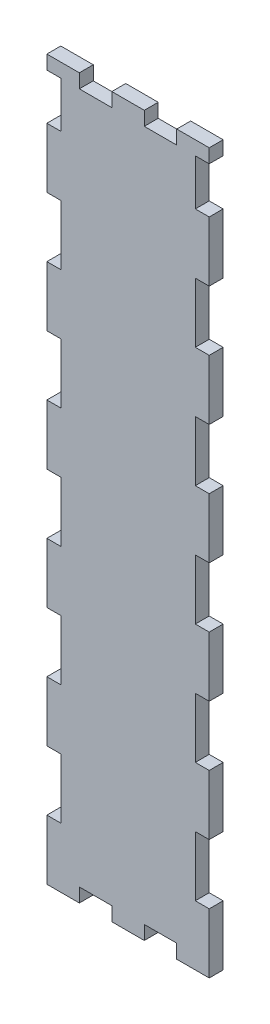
ISO-10303-21;
HEADER;
FILE_DESCRIPTION(('STEP AP214'),'2;1');
FILE_NAME('part.step','',(''),(''),'','','');
FILE_SCHEMA(('AUTOMOTIVE_DESIGN { 1 0 10303 214 1 1 1 1 }'));
ENDSEC;
DATA;
#1=APPLICATION_CONTEXT('core data for automotive mechanical design processes');
#2=APPLICATION_PROTOCOL_DEFINITION('international standard','automotive_design',2000,#1);
#3=PRODUCT_CONTEXT('',#1,'mechanical');
#4=PRODUCT('Part','Part','',(#3));
#5=PRODUCT_RELATED_PRODUCT_CATEGORY('part','',(#4));
#6=PRODUCT_DEFINITION_FORMATION('','',#4);
#7=PRODUCT_DEFINITION_CONTEXT('part definition',#1,'design');
#8=PRODUCT_DEFINITION('design','',#6,#7);
#9=PRODUCT_DEFINITION_SHAPE('','',#8);
#10=(LENGTH_UNIT() NAMED_UNIT(*) SI_UNIT(.MILLI.,.METRE.));
#11=(NAMED_UNIT(*) PLANE_ANGLE_UNIT() SI_UNIT($,.RADIAN.));
#12=(NAMED_UNIT(*) SI_UNIT($,.STERADIAN.) SOLID_ANGLE_UNIT());
#13=UNCERTAINTY_MEASURE_WITH_UNIT(LENGTH_MEASURE(1.E-05),#10,'distance_accuracy_value','');
#14=(GEOMETRIC_REPRESENTATION_CONTEXT(3) GLOBAL_UNCERTAINTY_ASSIGNED_CONTEXT((#13)) GLOBAL_UNIT_ASSIGNED_CONTEXT((#10,
#11,#12)) REPRESENTATION_CONTEXT('',''));
#15=CARTESIAN_POINT('',(0.,0.,0.));
#16=DIRECTION('',(0.,0.,1.));
#17=DIRECTION('',(1.,0.,0.));
#18=AXIS2_PLACEMENT_3D('',#15,#16,#17);
#19=CARTESIAN_POINT('',(-17.5,77.5,3.));
#20=DIRECTION('',(1.,0.,0.));
#21=DIRECTION('',(0.,1.,0.));
#22=AXIS2_PLACEMENT_3D('',#19,#20,#21);
#23=PLANE('',#22);
#24=DIRECTION('',(0.,-1.,0.));
#25=VECTOR('',#24,1.);
#26=CARTESIAN_POINT('',(-17.5,77.5,3.));
#27=LINE('',#26,#25);
#28=CARTESIAN_POINT('',(-17.5,64.5833333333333,3.));
#29=VERTEX_POINT('',#28);
#30=CARTESIAN_POINT('',(-17.5,51.6666666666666,2.99999999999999));
#31=VERTEX_POINT('',#30);
#32=EDGE_CURVE('E579',#29,#31,#27,.T.);
#33=ORIENTED_EDGE('',*,*,#32,.F.);
#34=DIRECTION('',(0.,0.,-1.));
#35=VECTOR('',#34,1.);
#36=CARTESIAN_POINT('',(-17.5,64.5833333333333,18.));
#37=LINE('',#36,#35);
#38=CARTESIAN_POINT('',(-17.5,64.5833333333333,0.));
#39=VERTEX_POINT('',#38);
#40=EDGE_CURVE('E806',#29,#39,#37,.T.);
#41=ORIENTED_EDGE('',*,*,#40,.T.);
#42=DIRECTION('',(0.,-1.,0.));
#43=VECTOR('',#42,1.);
#44=CARTESIAN_POINT('',(-17.5,77.5,0.));
#45=LINE('',#44,#43);
#46=CARTESIAN_POINT('',(-17.5,51.6666666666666,0.));
#47=VERTEX_POINT('',#46);
#48=EDGE_CURVE('E627',#39,#47,#45,.T.);
#49=ORIENTED_EDGE('',*,*,#48,.T.);
#50=DIRECTION('',(0.,0.,1.));
#51=VECTOR('',#50,1.);
#52=CARTESIAN_POINT('',(-17.5,51.6666666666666,-41.));
#53=LINE('',#52,#51);
#54=EDGE_CURVE('E528',#47,#31,#53,.T.);
#55=ORIENTED_EDGE('',*,*,#54,.T.);
#56=EDGE_LOOP('',(#33,#41,#49,#55));
#57=FACE_BOUND('',#56,.T.);
#58=ADVANCED_FACE('F35',(#57),#23,.F.);
#59=DIRECTION('',(0.,0.,-1.));
#60=VECTOR('',#59,1.);
#61=CARTESIAN_POINT('',(-17.5,25.8333333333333,18.));
#62=LINE('',#61,#60);
#63=CARTESIAN_POINT('',(-17.5,25.8333333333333,3.));
#64=VERTEX_POINT('',#63);
#65=CARTESIAN_POINT('',(-17.5,25.8333333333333,0.));
#66=VERTEX_POINT('',#65);
#67=EDGE_CURVE('E898',#64,#66,#62,.T.);
#68=ORIENTED_EDGE('',*,*,#67,.F.);
#69=CARTESIAN_POINT('',(-17.5,38.75,2.99999999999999));
#70=VERTEX_POINT('',#69);
#71=EDGE_CURVE('E580',#70,#64,#27,.T.);
#72=ORIENTED_EDGE('',*,*,#71,.F.);
#73=DIRECTION('',(0.,0.,1.));
#74=VECTOR('',#73,1.);
#75=CARTESIAN_POINT('',(-17.5,38.75,-41.));
#76=LINE('',#75,#74);
#77=CARTESIAN_POINT('',(-17.5,38.75,0.));
#78=VERTEX_POINT('',#77);
#79=EDGE_CURVE('E536',#78,#70,#76,.T.);
#80=ORIENTED_EDGE('',*,*,#79,.F.);
#81=EDGE_CURVE('E628',#78,#66,#45,.T.);
#82=ORIENTED_EDGE('',*,*,#81,.T.);
#83=EDGE_LOOP('',(#68,#72,#80,#82));
#84=FACE_BOUND('',#83,.T.);
#85=ADVANCED_FACE('F1033',(#84),#23,.F.);
#86=DIRECTION('',(0.,0.,-1.));
#87=VECTOR('',#86,1.);
#88=CARTESIAN_POINT('',(-17.5,12.9166666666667,18.));
#89=LINE('',#88,#87);
#90=CARTESIAN_POINT('',(-17.5,12.9166666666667,3.));
#91=VERTEX_POINT('',#90);
#92=CARTESIAN_POINT('',(-17.5,12.9166666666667,0.));
#93=VERTEX_POINT('',#92);
#94=EDGE_CURVE('E900',#91,#93,#89,.T.);
#95=ORIENTED_EDGE('',*,*,#94,.T.);
#96=CARTESIAN_POINT('',(-17.5,0.,0.));
#97=VERTEX_POINT('',#96);
#98=EDGE_CURVE('E813',#93,#97,#45,.T.);
#99=ORIENTED_EDGE('',*,*,#98,.T.);
#100=DIRECTION('',(0.,0.,-1.));
#101=VECTOR('',#100,1.);
#102=CARTESIAN_POINT('',(-17.5,0.,18.));
#103=LINE('',#102,#101);
#104=CARTESIAN_POINT('',(-17.5,0.,3.));
#105=VERTEX_POINT('',#104);
#106=EDGE_CURVE('E908',#105,#97,#103,.T.);
#107=ORIENTED_EDGE('',*,*,#106,.F.);
#108=EDGE_CURVE('E865',#91,#105,#27,.T.);
#109=ORIENTED_EDGE('',*,*,#108,.F.);
#110=EDGE_LOOP('',(#95,#99,#107,#109));
#111=FACE_BOUND('',#110,.T.);
#112=ADVANCED_FACE('F1023',(#111),#23,.F.);
#113=DIRECTION('',(0.,0.,-1.));
#114=VECTOR('',#113,1.);
#115=CARTESIAN_POINT('',(-17.5,-25.8333333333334,18.));
#116=LINE('',#115,#114);
#117=CARTESIAN_POINT('',(-17.5,-25.8333333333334,3.));
#118=VERTEX_POINT('',#117);
#119=CARTESIAN_POINT('',(-17.5,-25.8333333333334,0.));
#120=VERTEX_POINT('',#119);
#121=EDGE_CURVE('E882',#118,#120,#116,.T.);
#122=ORIENTED_EDGE('',*,*,#121,.F.);
#123=CARTESIAN_POINT('',(-17.5,-12.9166666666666,3.));
#124=VERTEX_POINT('',#123);
#125=EDGE_CURVE('E861',#124,#118,#27,.T.);
#126=ORIENTED_EDGE('',*,*,#125,.F.);
#127=DIRECTION('',(0.,0.,-1.));
#128=VECTOR('',#127,1.);
#129=CARTESIAN_POINT('',(-17.5,-12.9166666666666,18.));
#130=LINE('',#129,#128);
#131=CARTESIAN_POINT('',(-17.5,-12.9166666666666,0.));
#132=VERTEX_POINT('',#131);
#133=EDGE_CURVE('E881',#124,#132,#130,.T.);
#134=ORIENTED_EDGE('',*,*,#133,.T.);
#135=EDGE_CURVE('E816',#132,#120,#45,.T.);
#136=ORIENTED_EDGE('',*,*,#135,.T.);
#137=EDGE_LOOP('',(#122,#126,#134,#136));
#138=FACE_BOUND('',#137,.T.);
#139=ADVANCED_FACE('F880',(#138),#23,.F.);
#140=DIRECTION('',(0.,0.,-1.));
#141=VECTOR('',#140,1.);
#142=CARTESIAN_POINT('',(-17.5,-38.75,18.));
#143=LINE('',#142,#141);
#144=CARTESIAN_POINT('',(-17.5,-38.75,3.));
#145=VERTEX_POINT('',#144);
#146=CARTESIAN_POINT('',(-17.5,-38.75,0.));
#147=VERTEX_POINT('',#146);
#148=EDGE_CURVE('E884',#145,#147,#143,.T.);
#149=ORIENTED_EDGE('',*,*,#148,.T.);
#150=CARTESIAN_POINT('',(-17.5,-51.6666666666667,0.));
#151=VERTEX_POINT('',#150);
#152=EDGE_CURVE('E822',#147,#151,#45,.T.);
#153=ORIENTED_EDGE('',*,*,#152,.T.);
#154=DIRECTION('',(0.,0.,-1.));
#155=VECTOR('',#154,1.);
#156=CARTESIAN_POINT('',(-17.5,-51.6666666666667,18.));
#157=LINE('',#156,#155);
#158=CARTESIAN_POINT('',(-17.5,-51.6666666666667,3.));
#159=VERTEX_POINT('',#158);
#160=EDGE_CURVE('E917',#159,#151,#157,.T.);
#161=ORIENTED_EDGE('',*,*,#160,.F.);
#162=EDGE_CURVE('E859',#145,#159,#27,.T.);
#163=ORIENTED_EDGE('',*,*,#162,.F.);
#164=EDGE_LOOP('',(#149,#153,#161,#163));
#165=FACE_BOUND('',#164,.T.);
#166=ADVANCED_FACE('F1008',(#165),#23,.F.);
#167=DIRECTION('',(0.,0.,-1.));
#168=VECTOR('',#167,1.);
#169=CARTESIAN_POINT('',(-17.5,-64.5833333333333,18.));
#170=LINE('',#169,#168);
#171=CARTESIAN_POINT('',(-17.5,-64.5833333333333,3.));
#172=VERTEX_POINT('',#171);
#173=CARTESIAN_POINT('',(-17.5,-64.5833333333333,0.));
#174=VERTEX_POINT('',#173);
#175=EDGE_CURVE('E839',#172,#174,#170,.T.);
#176=ORIENTED_EDGE('',*,*,#175,.T.);
#177=CARTESIAN_POINT('',(-17.5,-77.5,0.));
#178=VERTEX_POINT('',#177);
#179=EDGE_CURVE('E622',#174,#178,#45,.T.);
#180=ORIENTED_EDGE('',*,*,#179,.T.);
#181=DIRECTION('',(0.,0.,-1.));
#182=VECTOR('',#181,1.);
#183=CARTESIAN_POINT('',(-17.5,-77.5,3.));
#184=LINE('',#183,#182);
#185=CARTESIAN_POINT('',(-17.5,-77.5,3.));
#186=VERTEX_POINT('',#185);
#187=EDGE_CURVE('E666',#186,#178,#184,.T.);
#188=ORIENTED_EDGE('',*,*,#187,.F.);
#189=EDGE_CURVE('E574',#172,#186,#27,.T.);
#190=ORIENTED_EDGE('',*,*,#189,.F.);
#191=EDGE_LOOP('',(#176,#180,#188,#190));
#192=FACE_BOUND('',#191,.T.);
#193=ADVANCED_FACE('F836',(#192),#23,.F.);
#194=CARTESIAN_POINT('',(0.,0.,3.));
#195=DIRECTION('',(0.,0.,-1.));
#196=DIRECTION('',(-1.,0.,0.));
#197=AXIS2_PLACEMENT_3D('',#194,#195,#196);
#198=PLANE('',#197);
#199=DIRECTION('',(0.,-1.,0.));
#200=VECTOR('',#199,1.);
#201=CARTESIAN_POINT('',(-14.5,0.,3.));
#202=LINE('',#201,#200);
#203=CARTESIAN_POINT('',(-14.5,74.5,3.));
#204=VERTEX_POINT('',#203);
#205=CARTESIAN_POINT('',(-14.5,64.5833333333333,3.));
#206=VERTEX_POINT('',#205);
#207=EDGE_CURVE('E523',#204,#206,#202,.T.);
#208=ORIENTED_EDGE('',*,*,#207,.T.);
#209=DIRECTION('',(-1.,0.,0.));
#210=VECTOR('',#209,1.);
#211=CARTESIAN_POINT('',(0.,64.5833333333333,3.));
#212=LINE('',#211,#210);
#213=EDGE_CURVE('E525',#206,#29,#212,.T.);
#214=ORIENTED_EDGE('',*,*,#213,.T.);
#215=ORIENTED_EDGE('',*,*,#32,.T.);
#216=DIRECTION('',(-1.,0.,0.));
#217=VECTOR('',#216,1.);
#218=CARTESIAN_POINT('',(-1.19503172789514E-12,51.666666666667,3.));
#219=LINE('',#218,#217);
#220=CARTESIAN_POINT('',(-14.5,51.6666666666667,2.99999999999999));
#221=VERTEX_POINT('',#220);
#222=EDGE_CURVE('E543',#221,#31,#219,.T.);
#223=ORIENTED_EDGE('',*,*,#222,.F.);
#224=DIRECTION('',(0.,1.,0.));
#225=VECTOR('',#224,1.);
#226=CARTESIAN_POINT('',(-14.5,0.,3.));
#227=LINE('',#226,#225);
#228=CARTESIAN_POINT('',(-14.5,38.75,2.99999999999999));
#229=VERTEX_POINT('',#228);
#230=EDGE_CURVE('E532',#229,#221,#227,.T.);
#231=ORIENTED_EDGE('',*,*,#230,.F.);
#232=DIRECTION('',(1.,0.,0.));
#233=VECTOR('',#232,1.);
#234=CARTESIAN_POINT('',(0.,38.75,3.));
#235=LINE('',#234,#233);
#236=EDGE_CURVE('E541',#70,#229,#235,.T.);
#237=ORIENTED_EDGE('',*,*,#236,.F.);
#238=ORIENTED_EDGE('',*,*,#71,.T.);
#239=DIRECTION('',(-1.,0.,0.));
#240=VECTOR('',#239,1.);
#241=CARTESIAN_POINT('',(-5.97515863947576E-13,25.8333333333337,3.));
#242=LINE('',#241,#240);
#243=CARTESIAN_POINT('',(-14.5,25.8333333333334,3.));
#244=VERTEX_POINT('',#243);
#245=EDGE_CURVE('E518',#244,#64,#242,.T.);
#246=ORIENTED_EDGE('',*,*,#245,.F.);
#247=DIRECTION('',(0.,1.,0.));
#248=VECTOR('',#247,1.);
#249=CARTESIAN_POINT('',(-14.5,0.,3.));
#250=LINE('',#249,#248);
#251=CARTESIAN_POINT('',(-14.5,12.9166666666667,3.));
#252=VERTEX_POINT('',#251);
#253=EDGE_CURVE('E514',#252,#244,#250,.T.);
#254=ORIENTED_EDGE('',*,*,#253,.F.);
#255=DIRECTION('',(1.,0.,0.));
#256=VECTOR('',#255,1.);
#257=CARTESIAN_POINT('',(0.,12.9166666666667,3.));
#258=LINE('',#257,#256);
#259=EDGE_CURVE('E516',#91,#252,#258,.T.);
#260=ORIENTED_EDGE('',*,*,#259,.F.);
#261=ORIENTED_EDGE('',*,*,#108,.T.);
#262=DIRECTION('',(-1.,0.,0.));
#263=VECTOR('',#262,1.);
#264=CARTESIAN_POINT('',(0.,3.82217405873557E-13,3.));
#265=LINE('',#264,#263);
#266=CARTESIAN_POINT('',(-14.5,0.,3.));
#267=VERTEX_POINT('',#266);
#268=EDGE_CURVE('E993',#267,#105,#265,.T.);
#269=ORIENTED_EDGE('',*,*,#268,.F.);
#270=DIRECTION('',(0.,1.,0.));
#271=VECTOR('',#270,1.);
#272=CARTESIAN_POINT('',(-14.5,0.,3.));
#273=LINE('',#272,#271);
#274=CARTESIAN_POINT('',(-14.5,-12.9166666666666,3.));
#275=VERTEX_POINT('',#274);
#276=EDGE_CURVE('E990',#275,#267,#273,.T.);
#277=ORIENTED_EDGE('',*,*,#276,.F.);
#278=DIRECTION('',(1.,0.,0.));
#279=VECTOR('',#278,1.);
#280=CARTESIAN_POINT('',(0.,-12.9166666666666,3.));
#281=LINE('',#280,#279);
#282=EDGE_CURVE('E879',#124,#275,#281,.T.);
#283=ORIENTED_EDGE('',*,*,#282,.F.);
#284=ORIENTED_EDGE('',*,*,#125,.T.);
#285=DIRECTION('',(-1.,0.,0.));
#286=VECTOR('',#285,1.);
#287=CARTESIAN_POINT('',(6.27391657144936E-13,-25.8333333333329,3.));
#288=LINE('',#287,#286);
#289=CARTESIAN_POINT('',(-14.5,-25.8333333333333,3.));
#290=VERTEX_POINT('',#289);
#291=EDGE_CURVE('E512',#290,#118,#288,.T.);
#292=ORIENTED_EDGE('',*,*,#291,.F.);
#293=DIRECTION('',(0.,1.,0.));
#294=VECTOR('',#293,1.);
#295=CARTESIAN_POINT('',(-14.5,0.,3.));
#296=LINE('',#295,#294);
#297=CARTESIAN_POINT('',(-14.5,-38.75,3.));
#298=VERTEX_POINT('',#297);
#299=EDGE_CURVE('E508',#298,#290,#296,.T.);
#300=ORIENTED_EDGE('',*,*,#299,.F.);
#301=DIRECTION('',(1.,0.,0.));
#302=VECTOR('',#301,1.);
#303=CARTESIAN_POINT('',(0.,-38.75,3.));
#304=LINE('',#303,#302);
#305=EDGE_CURVE('E510',#145,#298,#304,.T.);
#306=ORIENTED_EDGE('',*,*,#305,.F.);
#307=ORIENTED_EDGE('',*,*,#162,.T.);
#308=DIRECTION('',(-1.,0.,0.));
#309=VECTOR('',#308,1.);
#310=CARTESIAN_POINT('',(1.19503172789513E-12,-51.6666666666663,3.));
#311=LINE('',#310,#309);
#312=CARTESIAN_POINT('',(-14.5,-51.6666666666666,3.));
#313=VERTEX_POINT('',#312);
#314=EDGE_CURVE('E489',#313,#159,#311,.T.);
#315=ORIENTED_EDGE('',*,*,#314,.F.);
#316=DIRECTION('',(0.,1.,0.));
#317=VECTOR('',#316,1.);
#318=CARTESIAN_POINT('',(-14.5,0.,3.));
#319=LINE('',#318,#317);
#320=CARTESIAN_POINT('',(-14.5,-64.5833333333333,3.));
#321=VERTEX_POINT('',#320);
#322=EDGE_CURVE('E995',#321,#313,#319,.T.);
#323=ORIENTED_EDGE('',*,*,#322,.F.);
#324=DIRECTION('',(1.,0.,0.));
#325=VECTOR('',#324,1.);
#326=CARTESIAN_POINT('',(0.,-64.5833333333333,3.));
#327=LINE('',#326,#325);
#328=EDGE_CURVE('E494',#172,#321,#327,.T.);
#329=ORIENTED_EDGE('',*,*,#328,.F.);
#330=ORIENTED_EDGE('',*,*,#189,.T.);
#331=DIRECTION('',(1.,0.,0.));
#332=VECTOR('',#331,1.);
#333=CARTESIAN_POINT('',(-17.5,-77.5,3.));
#334=LINE('',#333,#332);
#335=CARTESIAN_POINT('',(-10.5,-77.5,3.));
#336=VERTEX_POINT('',#335);
#337=EDGE_CURVE('E578',#186,#336,#334,.T.);
#338=ORIENTED_EDGE('',*,*,#337,.T.);
#339=DIRECTION('',(0.,1.,0.));
#340=VECTOR('',#339,1.);
#341=CARTESIAN_POINT('',(-10.5,-74.5,3.));
#342=LINE('',#341,#340);
#343=CARTESIAN_POINT('',(-10.5,-74.5,3.));
#344=VERTEX_POINT('',#343);
#345=EDGE_CURVE('E582',#336,#344,#342,.T.);
#346=ORIENTED_EDGE('',*,*,#345,.T.);
#347=DIRECTION('',(1.,0.,0.));
#348=VECTOR('',#347,1.);
#349=CARTESIAN_POINT('',(-10.5,-74.5,3.));
#350=LINE('',#349,#348);
#351=CARTESIAN_POINT('',(-3.50000000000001,-74.5,3.));
#352=VERTEX_POINT('',#351);
#353=EDGE_CURVE('E584',#344,#352,#350,.T.);
#354=ORIENTED_EDGE('',*,*,#353,.T.);
#355=DIRECTION('',(0.,-1.,0.));
#356=VECTOR('',#355,1.);
#357=CARTESIAN_POINT('',(-3.50000000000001,-74.5,3.));
#358=LINE('',#357,#356);
#359=CARTESIAN_POINT('',(-3.50000000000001,-77.5,3.));
#360=VERTEX_POINT('',#359);
#361=EDGE_CURVE('E586',#352,#360,#358,.T.);
#362=ORIENTED_EDGE('',*,*,#361,.T.);
#363=DIRECTION('',(1.,0.,0.));
#364=VECTOR('',#363,1.);
#365=CARTESIAN_POINT('',(-3.50000000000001,-77.5,3.));
#366=LINE('',#365,#364);
#367=CARTESIAN_POINT('',(3.49999999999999,-77.5,3.));
#368=VERTEX_POINT('',#367);
#369=EDGE_CURVE('E588',#360,#368,#366,.T.);
#370=ORIENTED_EDGE('',*,*,#369,.T.);
#371=DIRECTION('',(0.,1.,0.));
#372=VECTOR('',#371,1.);
#373=CARTESIAN_POINT('',(3.49999999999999,-74.5,3.));
#374=LINE('',#373,#372);
#375=CARTESIAN_POINT('',(3.49999999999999,-74.5,3.));
#376=VERTEX_POINT('',#375);
#377=EDGE_CURVE('E590',#368,#376,#374,.T.);
#378=ORIENTED_EDGE('',*,*,#377,.T.);
#379=DIRECTION('',(1.,0.,0.));
#380=VECTOR('',#379,1.);
#381=CARTESIAN_POINT('',(3.49999999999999,-74.5,3.));
#382=LINE('',#381,#380);
#383=CARTESIAN_POINT('',(10.5,-74.5,3.));
#384=VERTEX_POINT('',#383);
#385=EDGE_CURVE('E592',#376,#384,#382,.T.);
#386=ORIENTED_EDGE('',*,*,#385,.T.);
#387=DIRECTION('',(0.,-1.,0.));
#388=VECTOR('',#387,1.);
#389=CARTESIAN_POINT('',(10.5,-74.5,3.));
#390=LINE('',#389,#388);
#391=CARTESIAN_POINT('',(10.5,-77.5,3.));
#392=VERTEX_POINT('',#391);
#393=EDGE_CURVE('E594',#384,#392,#390,.T.);
#394=ORIENTED_EDGE('',*,*,#393,.T.);
#395=DIRECTION('',(1.,0.,0.));
#396=VECTOR('',#395,1.);
#397=CARTESIAN_POINT('',(10.5,-77.5,3.));
#398=LINE('',#397,#396);
#399=CARTESIAN_POINT('',(17.5,-77.5,3.));
#400=VERTEX_POINT('',#399);
#401=EDGE_CURVE('E547',#392,#400,#398,.T.);
#402=ORIENTED_EDGE('',*,*,#401,.T.);
#403=DIRECTION('',(0.,1.,0.));
#404=VECTOR('',#403,1.);
#405=CARTESIAN_POINT('',(17.5,77.5,3.));
#406=LINE('',#405,#404);
#407=CARTESIAN_POINT('',(17.5,-64.5833333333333,3.));
#408=VERTEX_POINT('',#407);
#409=EDGE_CURVE('E552',#400,#408,#406,.T.);
#410=ORIENTED_EDGE('',*,*,#409,.T.);
#411=DIRECTION('',(1.,0.,0.));
#412=VECTOR('',#411,1.);
#413=CARTESIAN_POINT('',(0.,-64.5833333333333,3.));
#414=LINE('',#413,#412);
#415=CARTESIAN_POINT('',(14.5,-64.5833333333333,3.));
#416=VERTEX_POINT('',#415);
#417=EDGE_CURVE('E983',#416,#408,#414,.T.);
#418=ORIENTED_EDGE('',*,*,#417,.F.);
#419=DIRECTION('',(0.,-1.,0.));
#420=VECTOR('',#419,1.);
#421=CARTESIAN_POINT('',(14.5,0.,3.));
#422=LINE('',#421,#420);
#423=CARTESIAN_POINT('',(14.5,-51.6666666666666,3.));
#424=VERTEX_POINT('',#423);
#425=EDGE_CURVE('E506',#424,#416,#422,.T.);
#426=ORIENTED_EDGE('',*,*,#425,.F.);
#427=DIRECTION('',(-1.,0.,0.));
#428=VECTOR('',#427,1.);
#429=CARTESIAN_POINT('',(-1.19503172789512E-12,-51.6666666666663,3.));
#430=LINE('',#429,#428);
#431=CARTESIAN_POINT('',(17.5,-51.6666666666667,3.));
#432=VERTEX_POINT('',#431);
#433=EDGE_CURVE('E988',#432,#424,#430,.T.);
#434=ORIENTED_EDGE('',*,*,#433,.F.);
#435=CARTESIAN_POINT('',(17.5,-38.7499999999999,3.));
#436=VERTEX_POINT('',#435);
#437=EDGE_CURVE('E556',#432,#436,#406,.T.);
#438=ORIENTED_EDGE('',*,*,#437,.T.);
#439=DIRECTION('',(-1.,0.,0.));
#440=VECTOR('',#439,1.);
#441=CARTESIAN_POINT('',(0.,-38.7499999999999,3.));
#442=LINE('',#441,#440);
#443=CARTESIAN_POINT('',(14.5,-38.7499999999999,3.));
#444=VERTEX_POINT('',#443);
#445=EDGE_CURVE('E487',#436,#444,#442,.T.);
#446=ORIENTED_EDGE('',*,*,#445,.T.);
#447=DIRECTION('',(0.,1.,0.));
#448=VECTOR('',#447,1.);
#449=CARTESIAN_POINT('',(14.5,0.,3.));
#450=LINE('',#449,#448);
#451=CARTESIAN_POINT('',(14.5,-25.8333333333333,3.));
#452=VERTEX_POINT('',#451);
#453=EDGE_CURVE('E476',#444,#452,#450,.T.);
#454=ORIENTED_EDGE('',*,*,#453,.T.);
#455=DIRECTION('',(1.,0.,0.));
#456=VECTOR('',#455,1.);
#457=CARTESIAN_POINT('',(-6.27391657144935E-13,-25.8333333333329,3.));
#458=LINE('',#457,#456);
#459=CARTESIAN_POINT('',(17.5,-25.8333333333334,3.));
#460=VERTEX_POINT('',#459);
#461=EDGE_CURVE('E459',#452,#460,#458,.T.);
#462=ORIENTED_EDGE('',*,*,#461,.T.);
#463=CARTESIAN_POINT('',(17.5,-12.9166666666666,3.));
#464=VERTEX_POINT('',#463);
#465=EDGE_CURVE('E1758',#460,#464,#406,.T.);
#466=ORIENTED_EDGE('',*,*,#465,.T.);
#467=DIRECTION('',(-1.,0.,0.));
#468=VECTOR('',#467,1.);
#469=CARTESIAN_POINT('',(0.,-12.9166666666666,3.));
#470=LINE('',#469,#468);
#471=CARTESIAN_POINT('',(14.5,-12.9166666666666,3.));
#472=VERTEX_POINT('',#471);
#473=EDGE_CURVE('E977',#464,#472,#470,.T.);
#474=ORIENTED_EDGE('',*,*,#473,.T.);
#475=DIRECTION('',(0.,1.,0.));
#476=VECTOR('',#475,1.);
#477=CARTESIAN_POINT('',(14.5,0.,3.));
#478=LINE('',#477,#476);
#479=CARTESIAN_POINT('',(14.5,0.,3.));
#480=VERTEX_POINT('',#479);
#481=EDGE_CURVE('E503',#472,#480,#478,.T.);
#482=ORIENTED_EDGE('',*,*,#481,.T.);
#483=DIRECTION('',(1.,0.,0.));
#484=VECTOR('',#483,1.);
#485=CARTESIAN_POINT('',(0.,3.82217405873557E-13,3.));
#486=LINE('',#485,#484);
#487=CARTESIAN_POINT('',(17.5,0.,3.));
#488=VERTEX_POINT('',#487);
#489=EDGE_CURVE('E972',#480,#488,#486,.T.);
#490=ORIENTED_EDGE('',*,*,#489,.T.);
#491=CARTESIAN_POINT('',(17.5,12.9166666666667,3.));
#492=VERTEX_POINT('',#491);
#493=EDGE_CURVE('E1755',#488,#492,#406,.T.);
#494=ORIENTED_EDGE('',*,*,#493,.T.);
#495=DIRECTION('',(-1.,0.,0.));
#496=VECTOR('',#495,1.);
#497=CARTESIAN_POINT('',(0.,12.9166666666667,3.));
#498=LINE('',#497,#496);
#499=CARTESIAN_POINT('',(14.5,12.9166666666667,3.));
#500=VERTEX_POINT('',#499);
#501=EDGE_CURVE('E947',#492,#500,#498,.T.);
#502=ORIENTED_EDGE('',*,*,#501,.T.);
#503=DIRECTION('',(0.,1.,0.));
#504=VECTOR('',#503,1.);
#505=CARTESIAN_POINT('',(14.5,0.,3.));
#506=LINE('',#505,#504);
#507=CARTESIAN_POINT('',(14.5,25.8333333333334,3.));
#508=VERTEX_POINT('',#507);
#509=EDGE_CURVE('E488',#500,#508,#506,.T.);
#510=ORIENTED_EDGE('',*,*,#509,.T.);
#511=DIRECTION('',(1.,0.,0.));
#512=VECTOR('',#511,1.);
#513=CARTESIAN_POINT('',(5.97515863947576E-13,25.8333333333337,3.));
#514=LINE('',#513,#512);
#515=CARTESIAN_POINT('',(17.5,25.8333333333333,3.));
#516=VERTEX_POINT('',#515);
#517=EDGE_CURVE('E942',#508,#516,#514,.T.);
#518=ORIENTED_EDGE('',*,*,#517,.T.);
#519=CARTESIAN_POINT('',(17.5,38.7500000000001,3.));
#520=VERTEX_POINT('',#519);
#521=EDGE_CURVE('E1753',#516,#520,#406,.T.);
#522=ORIENTED_EDGE('',*,*,#521,.T.);
#523=DIRECTION('',(-1.,0.,0.));
#524=VECTOR('',#523,1.);
#525=CARTESIAN_POINT('',(0.,38.7500000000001,3.));
#526=LINE('',#525,#524);
#527=CARTESIAN_POINT('',(14.5,38.7500000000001,3.));
#528=VERTEX_POINT('',#527);
#529=EDGE_CURVE('E967',#520,#528,#526,.T.);
#530=ORIENTED_EDGE('',*,*,#529,.T.);
#531=DIRECTION('',(0.,1.,0.));
#532=VECTOR('',#531,1.);
#533=CARTESIAN_POINT('',(14.5,0.,3.));
#534=LINE('',#533,#532);
#535=CARTESIAN_POINT('',(14.5,51.6666666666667,3.));
#536=VERTEX_POINT('',#535);
#537=EDGE_CURVE('E500',#528,#536,#534,.T.);
#538=ORIENTED_EDGE('',*,*,#537,.T.);
#539=DIRECTION('',(1.,0.,0.));
#540=VECTOR('',#539,1.);
#541=CARTESIAN_POINT('',(1.19503172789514E-12,51.6666666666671,3.));
#542=LINE('',#541,#540);
#543=CARTESIAN_POINT('',(17.5,51.6666666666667,3.));
#544=VERTEX_POINT('',#543);
#545=EDGE_CURVE('E962',#536,#544,#542,.T.);
#546=ORIENTED_EDGE('',*,*,#545,.T.);
#547=CARTESIAN_POINT('',(17.5,64.5833333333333,3.));
#548=VERTEX_POINT('',#547);
#549=EDGE_CURVE('E1752',#544,#548,#406,.T.);
#550=ORIENTED_EDGE('',*,*,#549,.T.);
#551=DIRECTION('',(-1.,0.,0.));
#552=VECTOR('',#551,1.);
#553=CARTESIAN_POINT('',(0.,64.5833333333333,3.));
#554=LINE('',#553,#552);
#555=CARTESIAN_POINT('',(14.5,64.5833333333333,3.));
#556=VERTEX_POINT('',#555);
#557=EDGE_CURVE('E952',#548,#556,#554,.T.);
#558=ORIENTED_EDGE('',*,*,#557,.T.);
#559=DIRECTION('',(0.,1.,0.));
#560=VECTOR('',#559,1.);
#561=CARTESIAN_POINT('',(14.5,0.,3.));
#562=LINE('',#561,#560);
#563=CARTESIAN_POINT('',(14.5,74.5,3.));
#564=VERTEX_POINT('',#563);
#565=EDGE_CURVE('E492',#556,#564,#562,.T.);
#566=ORIENTED_EDGE('',*,*,#565,.T.);
#567=DIRECTION('',(-1.,0.,0.));
#568=VECTOR('',#567,1.);
#569=CARTESIAN_POINT('',(0.,74.5,3.));
#570=LINE('',#569,#568);
#571=CARTESIAN_POINT('',(17.5,74.5,3.));
#572=VERTEX_POINT('',#571);
#573=EDGE_CURVE('E958',#572,#564,#570,.T.);
#574=ORIENTED_EDGE('',*,*,#573,.F.);
#575=CARTESIAN_POINT('',(17.5,77.5,3.));
#576=VERTEX_POINT('',#575);
#577=EDGE_CURVE('E550',#572,#576,#406,.T.);
#578=ORIENTED_EDGE('',*,*,#577,.T.);
#579=DIRECTION('',(-1.,0.,0.));
#580=VECTOR('',#579,1.);
#581=CARTESIAN_POINT('',(10.5,77.5,3.));
#582=LINE('',#581,#580);
#583=CARTESIAN_POINT('',(10.5,77.5,3.));
#584=VERTEX_POINT('',#583);
#585=EDGE_CURVE('E555',#576,#584,#582,.T.);
#586=ORIENTED_EDGE('',*,*,#585,.T.);
#587=DIRECTION('',(0.,-1.,0.));
#588=VECTOR('',#587,1.);
#589=CARTESIAN_POINT('',(10.5,74.5,3.));
#590=LINE('',#589,#588);
#591=CARTESIAN_POINT('',(10.5,74.5,3.));
#592=VERTEX_POINT('',#591);
#593=EDGE_CURVE('E558',#584,#592,#590,.T.);
#594=ORIENTED_EDGE('',*,*,#593,.T.);
#595=DIRECTION('',(-1.,0.,0.));
#596=VECTOR('',#595,1.);
#597=CARTESIAN_POINT('',(3.49999999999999,74.5,3.));
#598=LINE('',#597,#596);
#599=CARTESIAN_POINT('',(3.49999999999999,74.5,3.));
#600=VERTEX_POINT('',#599);
#601=EDGE_CURVE('E560',#592,#600,#598,.T.);
#602=ORIENTED_EDGE('',*,*,#601,.T.);
#603=DIRECTION('',(0.,1.,0.));
#604=VECTOR('',#603,1.);
#605=CARTESIAN_POINT('',(3.49999999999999,74.5,3.));
#606=LINE('',#605,#604);
#607=CARTESIAN_POINT('',(3.49999999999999,77.5,3.));
#608=VERTEX_POINT('',#607);
#609=EDGE_CURVE('E562',#600,#608,#606,.T.);
#610=ORIENTED_EDGE('',*,*,#609,.T.);
#611=DIRECTION('',(-1.,0.,0.));
#612=VECTOR('',#611,1.);
#613=CARTESIAN_POINT('',(-3.50000000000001,77.5,3.));
#614=LINE('',#613,#612);
#615=CARTESIAN_POINT('',(-3.50000000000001,77.5,3.));
#616=VERTEX_POINT('',#615);
#617=EDGE_CURVE('E564',#608,#616,#614,.T.);
#618=ORIENTED_EDGE('',*,*,#617,.T.);
#619=DIRECTION('',(0.,-1.,0.));
#620=VECTOR('',#619,1.);
#621=CARTESIAN_POINT('',(-3.50000000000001,74.5,3.));
#622=LINE('',#621,#620);
#623=CARTESIAN_POINT('',(-3.50000000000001,74.5,3.));
#624=VERTEX_POINT('',#623);
#625=EDGE_CURVE('E566',#616,#624,#622,.T.);
#626=ORIENTED_EDGE('',*,*,#625,.T.);
#627=DIRECTION('',(-1.,0.,0.));
#628=VECTOR('',#627,1.);
#629=CARTESIAN_POINT('',(-10.5,74.5,3.));
#630=LINE('',#629,#628);
#631=CARTESIAN_POINT('',(-10.5,74.5,3.));
#632=VERTEX_POINT('',#631);
#633=EDGE_CURVE('E568',#624,#632,#630,.T.);
#634=ORIENTED_EDGE('',*,*,#633,.T.);
#635=DIRECTION('',(0.,1.,0.));
#636=VECTOR('',#635,1.);
#637=CARTESIAN_POINT('',(-10.5,74.5,3.));
#638=LINE('',#637,#636);
#639=CARTESIAN_POINT('',(-10.5,77.5,3.));
#640=VERTEX_POINT('',#639);
#641=EDGE_CURVE('E570',#632,#640,#638,.T.);
#642=ORIENTED_EDGE('',*,*,#641,.T.);
#643=DIRECTION('',(-1.,0.,0.));
#644=VECTOR('',#643,1.);
#645=CARTESIAN_POINT('',(-17.5,77.5,3.));
#646=LINE('',#645,#644);
#647=CARTESIAN_POINT('',(-17.5,77.5,3.));
#648=VERTEX_POINT('',#647);
#649=EDGE_CURVE('E572',#640,#648,#646,.T.);
#650=ORIENTED_EDGE('',*,*,#649,.T.);
#651=CARTESIAN_POINT('',(-17.5,74.5,3.));
#652=VERTEX_POINT('',#651);
#653=EDGE_CURVE('E575',#648,#652,#27,.T.);
#654=ORIENTED_EDGE('',*,*,#653,.T.);
#655=DIRECTION('',(1.,0.,0.));
#656=VECTOR('',#655,1.);
#657=CARTESIAN_POINT('',(0.,74.5,3.));
#658=LINE('',#657,#656);
#659=EDGE_CURVE('E520',#652,#204,#658,.T.);
#660=ORIENTED_EDGE('',*,*,#659,.T.);
#661=EDGE_LOOP('',(#208,#214,#215,#223,#231,#237,#238,#246,#254,#260,#261,#269,#277,#283,#284,
#292,#300,#306,#307,#315,#323,#329,#330,#338,#346,#354,#362,#370,#378,#386,#394,#402,#410,#418,
#426,#434,#438,#446,#454,#462,#466,#474,#482,#490,#494,#502,#510,#518,#522,#530,#538,#546,#550,
#558,#566,#574,#578,#586,#594,#602,#610,#618,#626,#634,#642,#650,#654,#660));
#662=FACE_BOUND('',#661,.T.);
#663=ADVANCED_FACE('F485',(#662),#198,.F.);
#664=CARTESIAN_POINT('',(0.,0.,0.));
#665=DIRECTION('',(0.,0.,-1.));
#666=DIRECTION('',(-1.,0.,0.));
#667=AXIS2_PLACEMENT_3D('',#664,#665,#666);
#668=PLANE('',#667);
#669=DIRECTION('',(-1.,0.,0.));
#670=VECTOR('',#669,1.);
#671=CARTESIAN_POINT('',(0.,64.5833333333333,0.));
#672=LINE('',#671,#670);
#673=CARTESIAN_POINT('',(-14.5,64.5833333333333,0.));
#674=VERTEX_POINT('',#673);
#675=EDGE_CURVE('E12',#674,#39,#672,.T.);
#676=ORIENTED_EDGE('',*,*,#675,.F.);
#677=DIRECTION('',(0.,-1.,0.));
#678=VECTOR('',#677,1.);
#679=CARTESIAN_POINT('',(-14.5,0.,0.));
#680=LINE('',#679,#678);
#681=CARTESIAN_POINT('',(-14.5,74.5,0.));
#682=VERTEX_POINT('',#681);
#683=EDGE_CURVE('E43',#682,#674,#680,.T.);
#684=ORIENTED_EDGE('',*,*,#683,.F.);
#685=DIRECTION('',(1.,0.,0.));
#686=VECTOR('',#685,1.);
#687=CARTESIAN_POINT('',(0.,74.5,0.));
#688=LINE('',#687,#686);
#689=CARTESIAN_POINT('',(-17.5,74.5,0.));
#690=VERTEX_POINT('',#689);
#691=EDGE_CURVE('E790',#690,#682,#688,.T.);
#692=ORIENTED_EDGE('',*,*,#691,.F.);
#693=CARTESIAN_POINT('',(-17.5,77.5,0.));
#694=VERTEX_POINT('',#693);
#695=EDGE_CURVE('E623',#694,#690,#45,.T.);
#696=ORIENTED_EDGE('',*,*,#695,.F.);
#697=DIRECTION('',(-1.,0.,0.));
#698=VECTOR('',#697,1.);
#699=CARTESIAN_POINT('',(-17.5,77.5,0.));
#700=LINE('',#699,#698);
#701=CARTESIAN_POINT('',(-10.5,77.5,0.));
#702=VERTEX_POINT('',#701);
#703=EDGE_CURVE('E620',#702,#694,#700,.T.);
#704=ORIENTED_EDGE('',*,*,#703,.F.);
#705=DIRECTION('',(0.,1.,0.));
#706=VECTOR('',#705,1.);
#707=CARTESIAN_POINT('',(-10.5,74.5,0.));
#708=LINE('',#707,#706);
#709=CARTESIAN_POINT('',(-10.5,74.5,0.));
#710=VERTEX_POINT('',#709);
#711=EDGE_CURVE('E618',#710,#702,#708,.T.);
#712=ORIENTED_EDGE('',*,*,#711,.F.);
#713=DIRECTION('',(-1.,0.,0.));
#714=VECTOR('',#713,1.);
#715=CARTESIAN_POINT('',(-10.5,74.5,0.));
#716=LINE('',#715,#714);
#717=CARTESIAN_POINT('',(-3.50000000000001,74.5,0.));
#718=VERTEX_POINT('',#717);
#719=EDGE_CURVE('E616',#718,#710,#716,.T.);
#720=ORIENTED_EDGE('',*,*,#719,.F.);
#721=DIRECTION('',(0.,-1.,0.));
#722=VECTOR('',#721,1.);
#723=CARTESIAN_POINT('',(-3.50000000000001,74.5,0.));
#724=LINE('',#723,#722);
#725=CARTESIAN_POINT('',(-3.50000000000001,77.5,0.));
#726=VERTEX_POINT('',#725);
#727=EDGE_CURVE('E614',#726,#718,#724,.T.);
#728=ORIENTED_EDGE('',*,*,#727,.F.);
#729=DIRECTION('',(-1.,0.,0.));
#730=VECTOR('',#729,1.);
#731=CARTESIAN_POINT('',(-3.50000000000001,77.5,0.));
#732=LINE('',#731,#730);
#733=CARTESIAN_POINT('',(3.49999999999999,77.5,0.));
#734=VERTEX_POINT('',#733);
#735=EDGE_CURVE('E612',#734,#726,#732,.T.);
#736=ORIENTED_EDGE('',*,*,#735,.F.);
#737=DIRECTION('',(0.,1.,0.));
#738=VECTOR('',#737,1.);
#739=CARTESIAN_POINT('',(3.49999999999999,74.5,0.));
#740=LINE('',#739,#738);
#741=CARTESIAN_POINT('',(3.49999999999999,74.5,0.));
#742=VERTEX_POINT('',#741);
#743=EDGE_CURVE('E610',#742,#734,#740,.T.);
#744=ORIENTED_EDGE('',*,*,#743,.F.);
#745=DIRECTION('',(-1.,0.,0.));
#746=VECTOR('',#745,1.);
#747=CARTESIAN_POINT('',(3.49999999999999,74.5,0.));
#748=LINE('',#747,#746);
#749=CARTESIAN_POINT('',(10.5,74.5,0.));
#750=VERTEX_POINT('',#749);
#751=EDGE_CURVE('E608',#750,#742,#748,.T.);
#752=ORIENTED_EDGE('',*,*,#751,.F.);
#753=DIRECTION('',(0.,-1.,0.));
#754=VECTOR('',#753,1.);
#755=CARTESIAN_POINT('',(10.5,74.5,0.));
#756=LINE('',#755,#754);
#757=CARTESIAN_POINT('',(10.5,77.5,0.));
#758=VERTEX_POINT('',#757);
#759=EDGE_CURVE('E606',#758,#750,#756,.T.);
#760=ORIENTED_EDGE('',*,*,#759,.F.);
#761=DIRECTION('',(-1.,0.,0.));
#762=VECTOR('',#761,1.);
#763=CARTESIAN_POINT('',(10.5,77.5,0.));
#764=LINE('',#763,#762);
#765=CARTESIAN_POINT('',(17.5,77.5,0.));
#766=VERTEX_POINT('',#765);
#767=EDGE_CURVE('E603',#766,#758,#764,.T.);
#768=ORIENTED_EDGE('',*,*,#767,.F.);
#769=DIRECTION('',(0.,1.,0.));
#770=VECTOR('',#769,1.);
#771=CARTESIAN_POINT('',(17.5,77.5,0.));
#772=LINE('',#771,#770);
#773=CARTESIAN_POINT('',(17.5,74.5,0.));
#774=VERTEX_POINT('',#773);
#775=EDGE_CURVE('E599',#774,#766,#772,.T.);
#776=ORIENTED_EDGE('',*,*,#775,.F.);
#777=DIRECTION('',(-1.,0.,0.));
#778=VECTOR('',#777,1.);
#779=CARTESIAN_POINT('',(0.,74.5,0.));
#780=LINE('',#779,#778);
#781=CARTESIAN_POINT('',(14.5,74.5,0.));
#782=VERTEX_POINT('',#781);
#783=EDGE_CURVE('E955',#774,#782,#780,.T.);
#784=ORIENTED_EDGE('',*,*,#783,.T.);
#785=DIRECTION('',(0.,1.,0.));
#786=VECTOR('',#785,1.);
#787=CARTESIAN_POINT('',(14.5,0.,0.));
#788=LINE('',#787,#786);
#789=CARTESIAN_POINT('',(14.5,64.5833333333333,0.));
#790=VERTEX_POINT('',#789);
#791=EDGE_CURVE('E763',#790,#782,#788,.T.);
#792=ORIENTED_EDGE('',*,*,#791,.F.);
#793=DIRECTION('',(-1.,0.,0.));
#794=VECTOR('',#793,1.);
#795=CARTESIAN_POINT('',(0.,64.5833333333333,0.));
#796=LINE('',#795,#794);
#797=CARTESIAN_POINT('',(17.5,64.5833333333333,0.));
#798=VERTEX_POINT('',#797);
#799=EDGE_CURVE('E950',#798,#790,#796,.T.);
#800=ORIENTED_EDGE('',*,*,#799,.F.);
#801=CARTESIAN_POINT('',(17.5,51.6666666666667,0.));
#802=VERTEX_POINT('',#801);
#803=EDGE_CURVE('E1102',#802,#798,#772,.T.);
#804=ORIENTED_EDGE('',*,*,#803,.F.);
#805=DIRECTION('',(1.,0.,0.));
#806=VECTOR('',#805,1.);
#807=CARTESIAN_POINT('',(1.19503172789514E-12,51.6666666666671,0.));
#808=LINE('',#807,#806);
#809=CARTESIAN_POINT('',(14.5,51.6666666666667,0.));
#810=VERTEX_POINT('',#809);
#811=EDGE_CURVE('E960',#810,#802,#808,.T.);
#812=ORIENTED_EDGE('',*,*,#811,.F.);
#813=DIRECTION('',(0.,1.,0.));
#814=VECTOR('',#813,1.);
#815=CARTESIAN_POINT('',(14.5,0.,0.));
#816=LINE('',#815,#814);
#817=CARTESIAN_POINT('',(14.5,38.7500000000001,0.));
#818=VERTEX_POINT('',#817);
#819=EDGE_CURVE('E765',#818,#810,#816,.T.);
#820=ORIENTED_EDGE('',*,*,#819,.F.);
#821=DIRECTION('',(-1.,0.,0.));
#822=VECTOR('',#821,1.);
#823=CARTESIAN_POINT('',(0.,38.7500000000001,0.));
#824=LINE('',#823,#822);
#825=CARTESIAN_POINT('',(17.5,38.7500000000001,0.));
#826=VERTEX_POINT('',#825);
#827=EDGE_CURVE('E965',#826,#818,#824,.T.);
#828=ORIENTED_EDGE('',*,*,#827,.F.);
#829=CARTESIAN_POINT('',(17.5,25.8333333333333,0.));
#830=VERTEX_POINT('',#829);
#831=EDGE_CURVE('E1104',#830,#826,#772,.T.);
#832=ORIENTED_EDGE('',*,*,#831,.F.);
#833=DIRECTION('',(1.,0.,0.));
#834=VECTOR('',#833,1.);
#835=CARTESIAN_POINT('',(5.97515863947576E-13,25.8333333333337,0.));
#836=LINE('',#835,#834);
#837=CARTESIAN_POINT('',(14.5,25.8333333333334,0.));
#838=VERTEX_POINT('',#837);
#839=EDGE_CURVE('E940',#838,#830,#836,.T.);
#840=ORIENTED_EDGE('',*,*,#839,.F.);
#841=DIRECTION('',(0.,1.,0.));
#842=VECTOR('',#841,1.);
#843=CARTESIAN_POINT('',(14.5,0.,0.));
#844=LINE('',#843,#842);
#845=CARTESIAN_POINT('',(14.5,12.9166666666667,0.));
#846=VERTEX_POINT('',#845);
#847=EDGE_CURVE('E761',#846,#838,#844,.T.);
#848=ORIENTED_EDGE('',*,*,#847,.F.);
#849=DIRECTION('',(-1.,0.,0.));
#850=VECTOR('',#849,1.);
#851=CARTESIAN_POINT('',(0.,12.9166666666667,0.));
#852=LINE('',#851,#850);
#853=CARTESIAN_POINT('',(17.5,12.9166666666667,0.));
#854=VERTEX_POINT('',#853);
#855=EDGE_CURVE('E945',#854,#846,#852,.T.);
#856=ORIENTED_EDGE('',*,*,#855,.F.);
#857=CARTESIAN_POINT('',(17.5,0.,0.));
#858=VERTEX_POINT('',#857);
#859=EDGE_CURVE('E1108',#858,#854,#772,.T.);
#860=ORIENTED_EDGE('',*,*,#859,.F.);
#861=DIRECTION('',(1.,0.,0.));
#862=VECTOR('',#861,1.);
#863=CARTESIAN_POINT('',(0.,3.82217405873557E-13,0.));
#864=LINE('',#863,#862);
#865=CARTESIAN_POINT('',(14.5,0.,0.));
#866=VERTEX_POINT('',#865);
#867=EDGE_CURVE('E970',#866,#858,#864,.T.);
#868=ORIENTED_EDGE('',*,*,#867,.F.);
#869=DIRECTION('',(0.,1.,0.));
#870=VECTOR('',#869,1.);
#871=CARTESIAN_POINT('',(14.5,0.,0.));
#872=LINE('',#871,#870);
#873=CARTESIAN_POINT('',(14.5,-12.9166666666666,0.));
#874=VERTEX_POINT('',#873);
#875=EDGE_CURVE('E767',#874,#866,#872,.T.);
#876=ORIENTED_EDGE('',*,*,#875,.F.);
#877=DIRECTION('',(-1.,0.,0.));
#878=VECTOR('',#877,1.);
#879=CARTESIAN_POINT('',(0.,-12.9166666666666,0.));
#880=LINE('',#879,#878);
#881=CARTESIAN_POINT('',(17.5,-12.9166666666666,0.));
#882=VERTEX_POINT('',#881);
#883=EDGE_CURVE('E975',#882,#874,#880,.T.);
#884=ORIENTED_EDGE('',*,*,#883,.F.);
#885=CARTESIAN_POINT('',(17.5,-25.8333333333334,0.));
#886=VERTEX_POINT('',#885);
#887=EDGE_CURVE('E1112',#886,#882,#772,.T.);
#888=ORIENTED_EDGE('',*,*,#887,.F.);
#889=DIRECTION('',(1.,0.,0.));
#890=VECTOR('',#889,1.);
#891=CARTESIAN_POINT('',(-6.27391657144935E-13,-25.8333333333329,0.));
#892=LINE('',#891,#890);
#893=CARTESIAN_POINT('',(14.5,-25.8333333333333,0.));
#894=VERTEX_POINT('',#893);
#895=EDGE_CURVE('E471',#894,#886,#892,.T.);
#896=ORIENTED_EDGE('',*,*,#895,.F.);
#897=DIRECTION('',(0.,1.,0.));
#898=VECTOR('',#897,1.);
#899=CARTESIAN_POINT('',(14.5,0.,0.));
#900=LINE('',#899,#898);
#901=CARTESIAN_POINT('',(14.5,-38.7499999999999,0.));
#902=VERTEX_POINT('',#901);
#903=EDGE_CURVE('E479',#902,#894,#900,.T.);
#904=ORIENTED_EDGE('',*,*,#903,.F.);
#905=DIRECTION('',(-1.,0.,0.));
#906=VECTOR('',#905,1.);
#907=CARTESIAN_POINT('',(0.,-38.7499999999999,0.));
#908=LINE('',#907,#906);
#909=CARTESIAN_POINT('',(17.5,-38.7499999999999,0.));
#910=VERTEX_POINT('',#909);
#911=EDGE_CURVE('E470',#910,#902,#908,.T.);
#912=ORIENTED_EDGE('',*,*,#911,.F.);
#913=CARTESIAN_POINT('',(17.5,-51.6666666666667,0.));
#914=VERTEX_POINT('',#913);
#915=EDGE_CURVE('E604',#914,#910,#772,.T.);
#916=ORIENTED_EDGE('',*,*,#915,.F.);
#917=DIRECTION('',(-1.,0.,0.));
#918=VECTOR('',#917,1.);
#919=CARTESIAN_POINT('',(-1.19503172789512E-12,-51.6666666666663,0.));
#920=LINE('',#919,#918);
#921=CARTESIAN_POINT('',(14.5,-51.6666666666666,0.));
#922=VERTEX_POINT('',#921);
#923=EDGE_CURVE('E985',#914,#922,#920,.T.);
#924=ORIENTED_EDGE('',*,*,#923,.T.);
#925=DIRECTION('',(0.,-1.,0.));
#926=VECTOR('',#925,1.);
#927=CARTESIAN_POINT('',(14.5,0.,0.));
#928=LINE('',#927,#926);
#929=CARTESIAN_POINT('',(14.5,-64.5833333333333,0.));
#930=VERTEX_POINT('',#929);
#931=EDGE_CURVE('E769',#922,#930,#928,.T.);
#932=ORIENTED_EDGE('',*,*,#931,.T.);
#933=DIRECTION('',(1.,0.,0.));
#934=VECTOR('',#933,1.);
#935=CARTESIAN_POINT('',(0.,-64.5833333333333,0.));
#936=LINE('',#935,#934);
#937=CARTESIAN_POINT('',(17.5,-64.5833333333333,0.));
#938=VERTEX_POINT('',#937);
#939=EDGE_CURVE('E980',#930,#938,#936,.T.);
#940=ORIENTED_EDGE('',*,*,#939,.T.);
#941=CARTESIAN_POINT('',(17.5,-77.5,0.));
#942=VERTEX_POINT('',#941);
#943=EDGE_CURVE('E600',#942,#938,#772,.T.);
#944=ORIENTED_EDGE('',*,*,#943,.F.);
#945=DIRECTION('',(1.,0.,0.));
#946=VECTOR('',#945,1.);
#947=CARTESIAN_POINT('',(10.5,-77.5,0.));
#948=LINE('',#947,#946);
#949=CARTESIAN_POINT('',(10.5,-77.5,0.));
#950=VERTEX_POINT('',#949);
#951=EDGE_CURVE('E546',#950,#942,#948,.T.);
#952=ORIENTED_EDGE('',*,*,#951,.F.);
#953=DIRECTION('',(0.,-1.,0.));
#954=VECTOR('',#953,1.);
#955=CARTESIAN_POINT('',(10.5,-74.5,0.));
#956=LINE('',#955,#954);
#957=CARTESIAN_POINT('',(10.5,-74.5,0.));
#958=VERTEX_POINT('',#957);
#959=EDGE_CURVE('E551',#958,#950,#956,.T.);
#960=ORIENTED_EDGE('',*,*,#959,.F.);
#961=DIRECTION('',(1.,0.,0.));
#962=VECTOR('',#961,1.);
#963=CARTESIAN_POINT('',(3.49999999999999,-74.5,0.));
#964=LINE('',#963,#962);
#965=CARTESIAN_POINT('',(3.49999999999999,-74.5,0.));
#966=VERTEX_POINT('',#965);
#967=EDGE_CURVE('E640',#966,#958,#964,.T.);
#968=ORIENTED_EDGE('',*,*,#967,.F.);
#969=DIRECTION('',(0.,1.,0.));
#970=VECTOR('',#969,1.);
#971=CARTESIAN_POINT('',(3.49999999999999,-74.5,0.));
#972=LINE('',#971,#970);
#973=CARTESIAN_POINT('',(3.49999999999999,-77.5,0.));
#974=VERTEX_POINT('',#973);
#975=EDGE_CURVE('E638',#974,#966,#972,.T.);
#976=ORIENTED_EDGE('',*,*,#975,.F.);
#977=DIRECTION('',(1.,0.,0.));
#978=VECTOR('',#977,1.);
#979=CARTESIAN_POINT('',(-3.50000000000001,-77.5,0.));
#980=LINE('',#979,#978);
#981=CARTESIAN_POINT('',(-3.50000000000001,-77.5,0.));
#982=VERTEX_POINT('',#981);
#983=EDGE_CURVE('E636',#982,#974,#980,.T.);
#984=ORIENTED_EDGE('',*,*,#983,.F.);
#985=DIRECTION('',(0.,-1.,0.));
#986=VECTOR('',#985,1.);
#987=CARTESIAN_POINT('',(-3.50000000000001,-74.5,0.));
#988=LINE('',#987,#986);
#989=CARTESIAN_POINT('',(-3.50000000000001,-74.5,0.));
#990=VERTEX_POINT('',#989);
#991=EDGE_CURVE('E634',#990,#982,#988,.T.);
#992=ORIENTED_EDGE('',*,*,#991,.F.);
#993=DIRECTION('',(1.,0.,0.));
#994=VECTOR('',#993,1.);
#995=CARTESIAN_POINT('',(-10.5,-74.5,0.));
#996=LINE('',#995,#994);
#997=CARTESIAN_POINT('',(-10.5,-74.5,0.));
#998=VERTEX_POINT('',#997);
#999=EDGE_CURVE('E632',#998,#990,#996,.T.);
#1000=ORIENTED_EDGE('',*,*,#999,.F.);
#1001=DIRECTION('',(0.,1.,0.));
#1002=VECTOR('',#1001,1.);
#1003=CARTESIAN_POINT('',(-10.5,-74.5,0.));
#1004=LINE('',#1003,#1002);
#1005=CARTESIAN_POINT('',(-10.5,-77.5,0.));
#1006=VERTEX_POINT('',#1005);
#1007=EDGE_CURVE('E630',#1006,#998,#1004,.T.);
#1008=ORIENTED_EDGE('',*,*,#1007,.F.);
#1009=DIRECTION('',(1.,0.,0.));
#1010=VECTOR('',#1009,1.);
#1011=CARTESIAN_POINT('',(-17.5,-77.5,0.));
#1012=LINE('',#1011,#1010);
#1013=EDGE_CURVE('E626',#178,#1006,#1012,.T.);
#1014=ORIENTED_EDGE('',*,*,#1013,.F.);
#1015=ORIENTED_EDGE('',*,*,#179,.F.);
#1016=DIRECTION('',(1.,0.,0.));
#1017=VECTOR('',#1016,1.);
#1018=CARTESIAN_POINT('',(0.,-64.5833333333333,0.));
#1019=LINE('',#1018,#1017);
#1020=CARTESIAN_POINT('',(-14.5,-64.5833333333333,0.));
#1021=VERTEX_POINT('',#1020);
#1022=EDGE_CURVE('E754',#174,#1021,#1019,.T.);
#1023=ORIENTED_EDGE('',*,*,#1022,.T.);
#1024=DIRECTION('',(0.,1.,0.));
#1025=VECTOR('',#1024,1.);
#1026=CARTESIAN_POINT('',(-14.5,0.,0.));
#1027=LINE('',#1026,#1025);
#1028=CARTESIAN_POINT('',(-14.5,-51.6666666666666,0.));
#1029=VERTEX_POINT('',#1028);
#1030=EDGE_CURVE('E751',#1021,#1029,#1027,.T.);
#1031=ORIENTED_EDGE('',*,*,#1030,.T.);
#1032=DIRECTION('',(-1.,0.,0.));
#1033=VECTOR('',#1032,1.);
#1034=CARTESIAN_POINT('',(1.19503172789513E-12,-51.6666666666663,0.));
#1035=LINE('',#1034,#1033);
#1036=EDGE_CURVE('E757',#1029,#151,#1035,.T.);
#1037=ORIENTED_EDGE('',*,*,#1036,.T.);
#1038=ORIENTED_EDGE('',*,*,#152,.F.);
#1039=DIRECTION('',(1.,0.,0.));
#1040=VECTOR('',#1039,1.);
#1041=CARTESIAN_POINT('',(0.,-38.75,0.));
#1042=LINE('',#1041,#1040);
#1043=CARTESIAN_POINT('',(-14.5,-38.75,0.));
#1044=VERTEX_POINT('',#1043);
#1045=EDGE_CURVE('E775',#147,#1044,#1042,.T.);
#1046=ORIENTED_EDGE('',*,*,#1045,.T.);
#1047=DIRECTION('',(0.,1.,0.));
#1048=VECTOR('',#1047,1.);
#1049=CARTESIAN_POINT('',(-14.5,0.,0.));
#1050=LINE('',#1049,#1048);
#1051=CARTESIAN_POINT('',(-14.5,-25.8333333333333,0.));
#1052=VERTEX_POINT('',#1051);
#1053=EDGE_CURVE('E772',#1044,#1052,#1050,.T.);
#1054=ORIENTED_EDGE('',*,*,#1053,.T.);
#1055=DIRECTION('',(-1.,0.,0.));
#1056=VECTOR('',#1055,1.);
#1057=CARTESIAN_POINT('',(6.27391657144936E-13,-25.8333333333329,0.));
#1058=LINE('',#1057,#1056);
#1059=EDGE_CURVE('E778',#1052,#120,#1058,.T.);
#1060=ORIENTED_EDGE('',*,*,#1059,.T.);
#1061=ORIENTED_EDGE('',*,*,#135,.F.);
#1062=DIRECTION('',(1.,0.,0.));
#1063=VECTOR('',#1062,1.);
#1064=CARTESIAN_POINT('',(0.,-12.9166666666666,0.));
#1065=LINE('',#1064,#1063);
#1066=CARTESIAN_POINT('',(-14.5,-12.9166666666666,0.));
#1067=VERTEX_POINT('',#1066);
#1068=EDGE_CURVE('E745',#132,#1067,#1065,.T.);
#1069=ORIENTED_EDGE('',*,*,#1068,.T.);
#1070=DIRECTION('',(0.,1.,0.));
#1071=VECTOR('',#1070,1.);
#1072=CARTESIAN_POINT('',(-14.5,0.,0.));
#1073=LINE('',#1072,#1071);
#1074=CARTESIAN_POINT('',(-14.5,0.,0.));
#1075=VERTEX_POINT('',#1074);
#1076=EDGE_CURVE('E742',#1067,#1075,#1073,.T.);
#1077=ORIENTED_EDGE('',*,*,#1076,.T.);
#1078=DIRECTION('',(-1.,0.,0.));
#1079=VECTOR('',#1078,1.);
#1080=CARTESIAN_POINT('',(0.,3.82217405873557E-13,0.));
#1081=LINE('',#1080,#1079);
#1082=EDGE_CURVE('E748',#1075,#97,#1081,.T.);
#1083=ORIENTED_EDGE('',*,*,#1082,.T.);
#1084=ORIENTED_EDGE('',*,*,#98,.F.);
#1085=DIRECTION('',(1.,0.,0.));
#1086=VECTOR('',#1085,1.);
#1087=CARTESIAN_POINT('',(0.,12.9166666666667,0.));
#1088=LINE('',#1087,#1086);
#1089=CARTESIAN_POINT('',(-14.5,12.9166666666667,0.));
#1090=VERTEX_POINT('',#1089);
#1091=EDGE_CURVE('E784',#93,#1090,#1088,.T.);
#1092=ORIENTED_EDGE('',*,*,#1091,.T.);
#1093=DIRECTION('',(0.,1.,0.));
#1094=VECTOR('',#1093,1.);
#1095=CARTESIAN_POINT('',(-14.5,0.,0.));
#1096=LINE('',#1095,#1094);
#1097=CARTESIAN_POINT('',(-14.5,25.8333333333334,0.));
#1098=VERTEX_POINT('',#1097);
#1099=EDGE_CURVE('E781',#1090,#1098,#1096,.T.);
#1100=ORIENTED_EDGE('',*,*,#1099,.T.);
#1101=DIRECTION('',(-1.,0.,0.));
#1102=VECTOR('',#1101,1.);
#1103=CARTESIAN_POINT('',(-5.97515863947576E-13,25.8333333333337,0.));
#1104=LINE('',#1103,#1102);
#1105=EDGE_CURVE('E787',#1098,#66,#1104,.T.);
#1106=ORIENTED_EDGE('',*,*,#1105,.T.);
#1107=ORIENTED_EDGE('',*,*,#81,.F.);
#1108=DIRECTION('',(1.,0.,0.));
#1109=VECTOR('',#1108,1.);
#1110=CARTESIAN_POINT('',(0.,38.75,0.));
#1111=LINE('',#1110,#1109);
#1112=CARTESIAN_POINT('',(-14.5,38.75,0.));
#1113=VERTEX_POINT('',#1112);
#1114=EDGE_CURVE('E705',#78,#1113,#1111,.T.);
#1115=ORIENTED_EDGE('',*,*,#1114,.T.);
#1116=DIRECTION('',(0.,1.,0.));
#1117=VECTOR('',#1116,1.);
#1118=CARTESIAN_POINT('',(-14.5,0.,0.));
#1119=LINE('',#1118,#1117);
#1120=CARTESIAN_POINT('',(-14.5,51.6666666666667,0.));
#1121=VERTEX_POINT('',#1120);
#1122=EDGE_CURVE('E702',#1113,#1121,#1119,.T.);
#1123=ORIENTED_EDGE('',*,*,#1122,.T.);
#1124=DIRECTION('',(-1.,0.,0.));
#1125=VECTOR('',#1124,1.);
#1126=CARTESIAN_POINT('',(-1.19503172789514E-12,51.666666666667,0.));
#1127=LINE('',#1126,#1125);
#1128=EDGE_CURVE('E708',#1121,#47,#1127,.T.);
#1129=ORIENTED_EDGE('',*,*,#1128,.T.);
#1130=ORIENTED_EDGE('',*,*,#48,.F.);
#1131=EDGE_LOOP('',(#676,#684,#692,#696,#704,#712,#720,#728,#736,#744,#752,#760,#768,#776,#784,
#792,#800,#804,#812,#820,#828,#832,#840,#848,#856,#860,#868,#876,#884,#888,#896,#904,#912,#916,
#924,#932,#940,#944,#952,#960,#968,#976,#984,#992,#1000,#1008,#1014,#1015,#1023,#1031,#1037,
#1038,#1046,#1054,#1060,#1061,#1069,#1077,#1083,#1084,#1092,#1100,#1106,#1107,#1115,#1123,#1129,#1130));
#1132=FACE_BOUND('',#1131,.T.);
#1133=ADVANCED_FACE('F809',(#1132),#668,.T.);
#1134=CARTESIAN_POINT('',(17.5,77.5,3.));
#1135=DIRECTION('',(-1.,0.,0.));
#1136=DIRECTION('',(0.,-1.,0.));
#1137=AXIS2_PLACEMENT_3D('',#1134,#1135,#1136);
#1138=PLANE('',#1137);
#1139=DIRECTION('',(0.,0.,1.));
#1140=VECTOR('',#1139,1.);
#1141=CARTESIAN_POINT('',(17.5,-51.6666666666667,3.));
#1142=LINE('',#1141,#1140);
#1143=EDGE_CURVE('E740',#914,#432,#1142,.T.);
#1144=ORIENTED_EDGE('',*,*,#1143,.F.);
#1145=ORIENTED_EDGE('',*,*,#915,.T.);
#1146=DIRECTION('',(0.,0.,1.));
#1147=VECTOR('',#1146,1.);
#1148=CARTESIAN_POINT('',(17.5,-38.7499999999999,3.));
#1149=LINE('',#1148,#1147);
#1150=EDGE_CURVE('E712',#910,#436,#1149,.T.);
#1151=ORIENTED_EDGE('',*,*,#1150,.T.);
#1152=ORIENTED_EDGE('',*,*,#437,.F.);
#1153=EDGE_LOOP('',(#1144,#1145,#1151,#1152));
#1154=FACE_BOUND('',#1153,.T.);
#1155=ADVANCED_FACE('F1122',(#1154),#1138,.F.);
#1156=DIRECTION('',(0.,0.,-1.));
#1157=VECTOR('',#1156,1.);
#1158=CARTESIAN_POINT('',(17.5,-64.5833333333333,3.));
#1159=LINE('',#1158,#1157);
#1160=EDGE_CURVE('E738',#408,#938,#1159,.T.);
#1161=ORIENTED_EDGE('',*,*,#1160,.F.);
#1162=ORIENTED_EDGE('',*,*,#409,.F.);
#1163=DIRECTION('',(0.,0.,-1.));
#1164=VECTOR('',#1163,1.);
#1165=CARTESIAN_POINT('',(17.5,-77.5,3.));
#1166=LINE('',#1165,#1164);
#1167=EDGE_CURVE('E699',#400,#942,#1166,.T.);
#1168=ORIENTED_EDGE('',*,*,#1167,.T.);
#1169=ORIENTED_EDGE('',*,*,#943,.T.);
#1170=EDGE_LOOP('',(#1161,#1162,#1168,#1169));
#1171=FACE_BOUND('',#1170,.T.);
#1172=ADVANCED_FACE('F1720',(#1171),#1138,.F.);
#1173=ORIENTED_EDGE('',*,*,#887,.T.);
#1174=DIRECTION('',(0.,0.,1.));
#1175=VECTOR('',#1174,1.);
#1176=CARTESIAN_POINT('',(17.5,-12.9166666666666,3.));
#1177=LINE('',#1176,#1175);
#1178=EDGE_CURVE('E735',#882,#464,#1177,.T.);
#1179=ORIENTED_EDGE('',*,*,#1178,.T.);
#1180=ORIENTED_EDGE('',*,*,#465,.F.);
#1181=DIRECTION('',(0.,0.,-1.));
#1182=VECTOR('',#1181,1.);
#1183=CARTESIAN_POINT('',(17.5,-25.8333333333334,3.));
#1184=LINE('',#1183,#1182);
#1185=EDGE_CURVE('E465',#460,#886,#1184,.T.);
#1186=ORIENTED_EDGE('',*,*,#1185,.T.);
#1187=EDGE_LOOP('',(#1173,#1179,#1180,#1186));
#1188=FACE_BOUND('',#1187,.T.);
#1189=ADVANCED_FACE('F1761',(#1188),#1138,.F.);
#1190=ORIENTED_EDGE('',*,*,#831,.T.);
#1191=DIRECTION('',(0.,0.,1.));
#1192=VECTOR('',#1191,1.);
#1193=CARTESIAN_POINT('',(17.5,38.7500000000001,3.));
#1194=LINE('',#1193,#1192);
#1195=EDGE_CURVE('E729',#826,#520,#1194,.T.);
#1196=ORIENTED_EDGE('',*,*,#1195,.T.);
#1197=ORIENTED_EDGE('',*,*,#521,.F.);
#1198=DIRECTION('',(0.,0.,-1.));
#1199=VECTOR('',#1198,1.);
#1200=CARTESIAN_POINT('',(17.5,25.8333333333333,3.));
#1201=LINE('',#1200,#1199);
#1202=EDGE_CURVE('E715',#516,#830,#1201,.T.);
#1203=ORIENTED_EDGE('',*,*,#1202,.T.);
#1204=EDGE_LOOP('',(#1190,#1196,#1197,#1203));
#1205=FACE_BOUND('',#1204,.T.);
#1206=ADVANCED_FACE('F1772',(#1205),#1138,.F.);
#1207=DIRECTION('',(0.,0.,1.));
#1208=VECTOR('',#1207,1.);
#1209=CARTESIAN_POINT('',(17.5,74.5,3.));
#1210=LINE('',#1209,#1208);
#1211=EDGE_CURVE('E724',#774,#572,#1210,.T.);
#1212=ORIENTED_EDGE('',*,*,#1211,.F.);
#1213=ORIENTED_EDGE('',*,*,#775,.T.);
#1214=DIRECTION('',(0.,0.,-1.));
#1215=VECTOR('',#1214,1.);
#1216=CARTESIAN_POINT('',(17.5,77.5,3.));
#1217=LINE('',#1216,#1215);
#1218=EDGE_CURVE('E696',#576,#766,#1217,.T.);
#1219=ORIENTED_EDGE('',*,*,#1218,.F.);
#1220=ORIENTED_EDGE('',*,*,#577,.F.);
#1221=EDGE_LOOP('',(#1212,#1213,#1219,#1220));
#1222=FACE_BOUND('',#1221,.T.);
#1223=ADVANCED_FACE('F1101',(#1222),#1138,.F.);
#1224=ORIENTED_EDGE('',*,*,#493,.F.);
#1225=DIRECTION('',(0.,0.,-1.));
#1226=VECTOR('',#1225,1.);
#1227=CARTESIAN_POINT('',(17.5,0.,3.));
#1228=LINE('',#1227,#1226);
#1229=EDGE_CURVE('E732',#488,#858,#1228,.T.);
#1230=ORIENTED_EDGE('',*,*,#1229,.T.);
#1231=ORIENTED_EDGE('',*,*,#859,.T.);
#1232=DIRECTION('',(0.,0.,1.));
#1233=VECTOR('',#1232,1.);
#1234=CARTESIAN_POINT('',(17.5,12.9166666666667,3.));
#1235=LINE('',#1234,#1233);
#1236=EDGE_CURVE('E718',#854,#492,#1235,.T.);
#1237=ORIENTED_EDGE('',*,*,#1236,.T.);
#1238=EDGE_LOOP('',(#1224,#1230,#1231,#1237));
#1239=FACE_BOUND('',#1238,.T.);
#1240=ADVANCED_FACE('F1145',(#1239),#1138,.F.);
#1241=ORIENTED_EDGE('',*,*,#695,.T.);
#1242=DIRECTION('',(0.,0.,-1.));
#1243=VECTOR('',#1242,1.);
#1244=CARTESIAN_POINT('',(-17.5,74.5,18.));
#1245=LINE('',#1244,#1243);
#1246=EDGE_CURVE('E904',#652,#690,#1245,.T.);
#1247=ORIENTED_EDGE('',*,*,#1246,.F.);
#1248=ORIENTED_EDGE('',*,*,#653,.F.);
#1249=DIRECTION('',(0.,0.,-1.));
#1250=VECTOR('',#1249,1.);
#1251=CARTESIAN_POINT('',(-17.5,77.5,3.));
#1252=LINE('',#1251,#1250);
#1253=EDGE_CURVE('E669',#648,#694,#1252,.T.);
#1254=ORIENTED_EDGE('',*,*,#1253,.T.);
#1255=EDGE_LOOP('',(#1241,#1247,#1248,#1254));
#1256=FACE_BOUND('',#1255,.T.);
#1257=ADVANCED_FACE('F1050',(#1256),#23,.F.);
#1258=CARTESIAN_POINT('',(10.5,-77.5,3.));
#1259=DIRECTION('',(0.,1.,0.));
#1260=DIRECTION('',(0.,0.,1.));
#1261=AXIS2_PLACEMENT_3D('',#1258,#1259,#1260);
#1262=PLANE('',#1261);
#1263=ORIENTED_EDGE('',*,*,#951,.T.);
#1264=ORIENTED_EDGE('',*,*,#1167,.F.);
#1265=ORIENTED_EDGE('',*,*,#401,.F.);
#1266=DIRECTION('',(0.,0.,-1.));
#1267=VECTOR('',#1266,1.);
#1268=CARTESIAN_POINT('',(10.5,-77.5,3.));
#1269=LINE('',#1268,#1267);
#1270=EDGE_CURVE('E596',#392,#950,#1269,.T.);
#1271=ORIENTED_EDGE('',*,*,#1270,.T.);
#1272=EDGE_LOOP('',(#1263,#1264,#1265,#1271));
#1273=FACE_BOUND('',#1272,.T.);
#1274=ADVANCED_FACE('F37',(#1273),#1262,.F.);
#1275=ORIENTED_EDGE('',*,*,#549,.F.);
#1276=DIRECTION('',(0.,0.,-1.));
#1277=VECTOR('',#1276,1.);
#1278=CARTESIAN_POINT('',(17.5,51.6666666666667,3.));
#1279=LINE('',#1278,#1277);
#1280=EDGE_CURVE('E726',#544,#802,#1279,.T.);
#1281=ORIENTED_EDGE('',*,*,#1280,.T.);
#1282=ORIENTED_EDGE('',*,*,#803,.T.);
#1283=DIRECTION('',(0.,0.,1.));
#1284=VECTOR('',#1283,1.);
#1285=CARTESIAN_POINT('',(17.5,64.5833333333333,3.));
#1286=LINE('',#1285,#1284);
#1287=EDGE_CURVE('E721',#798,#548,#1286,.T.);
#1288=ORIENTED_EDGE('',*,*,#1287,.T.);
#1289=EDGE_LOOP('',(#1275,#1281,#1282,#1288));
#1290=FACE_BOUND('',#1289,.T.);
#1291=ADVANCED_FACE('F1150',(#1290),#1138,.F.);
#1292=CARTESIAN_POINT('',(10.5,77.5,3.));
#1293=DIRECTION('',(0.,-1.,0.));
#1294=DIRECTION('',(0.,0.,-1.));
#1295=AXIS2_PLACEMENT_3D('',#1292,#1293,#1294);
#1296=PLANE('',#1295);
#1297=ORIENTED_EDGE('',*,*,#767,.T.);
#1298=DIRECTION('',(0.,0.,-1.));
#1299=VECTOR('',#1298,1.);
#1300=CARTESIAN_POINT('',(10.5,77.5,3.));
#1301=LINE('',#1300,#1299);
#1302=EDGE_CURVE('E693',#584,#758,#1301,.T.);
#1303=ORIENTED_EDGE('',*,*,#1302,.F.);
#1304=ORIENTED_EDGE('',*,*,#585,.F.);
#1305=ORIENTED_EDGE('',*,*,#1218,.T.);
#1306=EDGE_LOOP('',(#1297,#1303,#1304,#1305));
#1307=FACE_BOUND('',#1306,.T.);
#1308=ADVANCED_FACE('F1096',(#1307),#1296,.F.);
#1309=CARTESIAN_POINT('',(10.5,74.5,3.));
#1310=DIRECTION('',(1.,0.,0.));
#1311=DIRECTION('',(0.,0.,-1.));
#1312=AXIS2_PLACEMENT_3D('',#1309,#1310,#1311);
#1313=PLANE('',#1312);
#1314=ORIENTED_EDGE('',*,*,#759,.T.);
#1315=DIRECTION('',(0.,0.,-1.));
#1316=VECTOR('',#1315,1.);
#1317=CARTESIAN_POINT('',(10.5,74.5,3.));
#1318=LINE('',#1317,#1316);
#1319=EDGE_CURVE('E690',#592,#750,#1318,.T.);
#1320=ORIENTED_EDGE('',*,*,#1319,.F.);
#1321=ORIENTED_EDGE('',*,*,#593,.F.);
#1322=ORIENTED_EDGE('',*,*,#1302,.T.);
#1323=EDGE_LOOP('',(#1314,#1320,#1321,#1322));
#1324=FACE_BOUND('',#1323,.T.);
#1325=ADVANCED_FACE('F1091',(#1324),#1313,.F.);
#1326=CARTESIAN_POINT('',(3.49999999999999,74.5,3.));
#1327=DIRECTION('',(0.,-1.,0.));
#1328=DIRECTION('',(0.,0.,-1.));
#1329=AXIS2_PLACEMENT_3D('',#1326,#1327,#1328);
#1330=PLANE('',#1329);
#1331=ORIENTED_EDGE('',*,*,#751,.T.);
#1332=DIRECTION('',(0.,0.,-1.));
#1333=VECTOR('',#1332,1.);
#1334=CARTESIAN_POINT('',(3.49999999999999,74.5,3.));
#1335=LINE('',#1334,#1333);
#1336=EDGE_CURVE('E687',#600,#742,#1335,.T.);
#1337=ORIENTED_EDGE('',*,*,#1336,.F.);
#1338=ORIENTED_EDGE('',*,*,#601,.F.);
#1339=ORIENTED_EDGE('',*,*,#1319,.T.);
#1340=EDGE_LOOP('',(#1331,#1337,#1338,#1339));
#1341=FACE_BOUND('',#1340,.T.);
#1342=ADVANCED_FACE('F1085',(#1341),#1330,.F.);
#1343=CARTESIAN_POINT('',(3.49999999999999,74.5,3.));
#1344=DIRECTION('',(-1.,0.,0.));
#1345=DIRECTION('',(0.,0.,1.));
#1346=AXIS2_PLACEMENT_3D('',#1343,#1344,#1345);
#1347=PLANE('',#1346);
#1348=ORIENTED_EDGE('',*,*,#743,.T.);
#1349=DIRECTION('',(0.,0.,-1.));
#1350=VECTOR('',#1349,1.);
#1351=CARTESIAN_POINT('',(3.49999999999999,77.5,3.));
#1352=LINE('',#1351,#1350);
#1353=EDGE_CURVE('E684',#608,#734,#1352,.T.);
#1354=ORIENTED_EDGE('',*,*,#1353,.F.);
#1355=ORIENTED_EDGE('',*,*,#609,.F.);
#1356=ORIENTED_EDGE('',*,*,#1336,.T.);
#1357=EDGE_LOOP('',(#1348,#1354,#1355,#1356));
#1358=FACE_BOUND('',#1357,.T.);
#1359=ADVANCED_FACE('F1081',(#1358),#1347,.F.);
#1360=CARTESIAN_POINT('',(-3.50000000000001,77.5,3.));
#1361=DIRECTION('',(0.,-1.,0.));
#1362=DIRECTION('',(0.,0.,-1.));
#1363=AXIS2_PLACEMENT_3D('',#1360,#1361,#1362);
#1364=PLANE('',#1363);
#1365=ORIENTED_EDGE('',*,*,#735,.T.);
#1366=DIRECTION('',(0.,0.,-1.));
#1367=VECTOR('',#1366,1.);
#1368=CARTESIAN_POINT('',(-3.50000000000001,77.5,3.));
#1369=LINE('',#1368,#1367);
#1370=EDGE_CURVE('E681',#616,#726,#1369,.T.);
#1371=ORIENTED_EDGE('',*,*,#1370,.F.);
#1372=ORIENTED_EDGE('',*,*,#617,.F.);
#1373=ORIENTED_EDGE('',*,*,#1353,.T.);
#1374=EDGE_LOOP('',(#1365,#1371,#1372,#1373));
#1375=FACE_BOUND('',#1374,.T.);
#1376=ADVANCED_FACE('F1076',(#1375),#1364,.F.);
#1377=CARTESIAN_POINT('',(-3.50000000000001,74.5,3.));
#1378=DIRECTION('',(1.,0.,0.));
#1379=DIRECTION('',(0.,0.,-1.));
#1380=AXIS2_PLACEMENT_3D('',#1377,#1378,#1379);
#1381=PLANE('',#1380);
#1382=ORIENTED_EDGE('',*,*,#727,.T.);
#1383=DIRECTION('',(0.,0.,-1.));
#1384=VECTOR('',#1383,1.);
#1385=CARTESIAN_POINT('',(-3.50000000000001,74.5,3.));
#1386=LINE('',#1385,#1384);
#1387=EDGE_CURVE('E678',#624,#718,#1386,.T.);
#1388=ORIENTED_EDGE('',*,*,#1387,.F.);
#1389=ORIENTED_EDGE('',*,*,#625,.F.);
#1390=ORIENTED_EDGE('',*,*,#1370,.T.);
#1391=EDGE_LOOP('',(#1382,#1388,#1389,#1390));
#1392=FACE_BOUND('',#1391,.T.);
#1393=ADVANCED_FACE('F1070',(#1392),#1381,.F.);
#1394=CARTESIAN_POINT('',(-10.5,74.5,3.));
#1395=DIRECTION('',(0.,-1.,0.));
#1396=DIRECTION('',(0.,0.,-1.));
#1397=AXIS2_PLACEMENT_3D('',#1394,#1395,#1396);
#1398=PLANE('',#1397);
#1399=ORIENTED_EDGE('',*,*,#719,.T.);
#1400=DIRECTION('',(0.,0.,-1.));
#1401=VECTOR('',#1400,1.);
#1402=CARTESIAN_POINT('',(-10.5,74.5,3.));
#1403=LINE('',#1402,#1401);
#1404=EDGE_CURVE('E675',#632,#710,#1403,.T.);
#1405=ORIENTED_EDGE('',*,*,#1404,.F.);
#1406=ORIENTED_EDGE('',*,*,#633,.F.);
#1407=ORIENTED_EDGE('',*,*,#1387,.T.);
#1408=EDGE_LOOP('',(#1399,#1405,#1406,#1407));
#1409=FACE_BOUND('',#1408,.T.);
#1410=ADVANCED_FACE('F1066',(#1409),#1398,.F.);
#1411=CARTESIAN_POINT('',(-10.5,74.5,3.));
#1412=DIRECTION('',(-1.,0.,0.));
#1413=DIRECTION('',(0.,0.,1.));
#1414=AXIS2_PLACEMENT_3D('',#1411,#1412,#1413);
#1415=PLANE('',#1414);
#1416=ORIENTED_EDGE('',*,*,#711,.T.);
#1417=DIRECTION('',(0.,0.,-1.));
#1418=VECTOR('',#1417,1.);
#1419=CARTESIAN_POINT('',(-10.5,77.5,3.));
#1420=LINE('',#1419,#1418);
#1421=EDGE_CURVE('E672',#640,#702,#1420,.T.);
#1422=ORIENTED_EDGE('',*,*,#1421,.F.);
#1423=ORIENTED_EDGE('',*,*,#641,.F.);
#1424=ORIENTED_EDGE('',*,*,#1404,.T.);
#1425=EDGE_LOOP('',(#1416,#1422,#1423,#1424));
#1426=FACE_BOUND('',#1425,.T.);
#1427=ADVANCED_FACE('F1061',(#1426),#1415,.F.);
#1428=CARTESIAN_POINT('',(-17.5,77.5,3.));
#1429=DIRECTION('',(0.,-1.,0.));
#1430=DIRECTION('',(0.,0.,-1.));
#1431=AXIS2_PLACEMENT_3D('',#1428,#1429,#1430);
#1432=PLANE('',#1431);
#1433=ORIENTED_EDGE('',*,*,#703,.T.);
#1434=ORIENTED_EDGE('',*,*,#1253,.F.);
#1435=ORIENTED_EDGE('',*,*,#649,.F.);
#1436=ORIENTED_EDGE('',*,*,#1421,.T.);
#1437=EDGE_LOOP('',(#1433,#1434,#1435,#1436));
#1438=FACE_BOUND('',#1437,.T.);
#1439=ADVANCED_FACE('F1055',(#1438),#1432,.F.);
#1440=CARTESIAN_POINT('',(-17.5,-77.5,3.));
#1441=DIRECTION('',(0.,1.,0.));
#1442=DIRECTION('',(0.,0.,1.));
#1443=AXIS2_PLACEMENT_3D('',#1440,#1441,#1442);
#1444=PLANE('',#1443);
#1445=ORIENTED_EDGE('',*,*,#1013,.T.);
#1446=DIRECTION('',(0.,0.,-1.));
#1447=VECTOR('',#1446,1.);
#1448=CARTESIAN_POINT('',(-10.5,-77.5,3.));
#1449=LINE('',#1448,#1447);
#1450=EDGE_CURVE('E663',#336,#1006,#1449,.T.);
#1451=ORIENTED_EDGE('',*,*,#1450,.F.);
#1452=ORIENTED_EDGE('',*,*,#337,.F.);
#1453=ORIENTED_EDGE('',*,*,#187,.T.);
#1454=EDGE_LOOP('',(#1445,#1451,#1452,#1453));
#1455=FACE_BOUND('',#1454,.T.);
#1456=ADVANCED_FACE('F842',(#1455),#1444,.F.);
#1457=CARTESIAN_POINT('',(-10.5,-74.5,3.));
#1458=DIRECTION('',(-1.,0.,0.));
#1459=DIRECTION('',(0.,0.,1.));
#1460=AXIS2_PLACEMENT_3D('',#1457,#1458,#1459);
#1461=PLANE('',#1460);
#1462=ORIENTED_EDGE('',*,*,#1007,.T.);
#1463=DIRECTION('',(0.,0.,-1.));
#1464=VECTOR('',#1463,1.);
#1465=CARTESIAN_POINT('',(-10.5,-74.5,3.));
#1466=LINE('',#1465,#1464);
#1467=EDGE_CURVE('E660',#344,#998,#1466,.T.);
#1468=ORIENTED_EDGE('',*,*,#1467,.F.);
#1469=ORIENTED_EDGE('',*,*,#345,.F.);
#1470=ORIENTED_EDGE('',*,*,#1450,.T.);
#1471=EDGE_LOOP('',(#1462,#1468,#1469,#1470));
#1472=FACE_BOUND('',#1471,.T.);
#1473=ADVANCED_FACE('F849',(#1472),#1461,.F.);
#1474=CARTESIAN_POINT('',(-10.5,-74.5,3.));
#1475=DIRECTION('',(0.,1.,0.));
#1476=DIRECTION('',(0.,0.,1.));
#1477=AXIS2_PLACEMENT_3D('',#1474,#1475,#1476);
#1478=PLANE('',#1477);
#1479=ORIENTED_EDGE('',*,*,#999,.T.);
#1480=DIRECTION('',(0.,0.,-1.));
#1481=VECTOR('',#1480,1.);
#1482=CARTESIAN_POINT('',(-3.50000000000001,-74.5,3.));
#1483=LINE('',#1482,#1481);
#1484=EDGE_CURVE('E657',#352,#990,#1483,.T.);
#1485=ORIENTED_EDGE('',*,*,#1484,.F.);
#1486=ORIENTED_EDGE('',*,*,#353,.F.);
#1487=ORIENTED_EDGE('',*,*,#1467,.T.);
#1488=EDGE_LOOP('',(#1479,#1485,#1486,#1487));
#1489=FACE_BOUND('',#1488,.T.);
#1490=ADVANCED_FACE('F853',(#1489),#1478,.F.);
#1491=CARTESIAN_POINT('',(-3.50000000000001,-74.5,3.));
#1492=DIRECTION('',(1.,0.,0.));
#1493=DIRECTION('',(0.,0.,-1.));
#1494=AXIS2_PLACEMENT_3D('',#1491,#1492,#1493);
#1495=PLANE('',#1494);
#1496=ORIENTED_EDGE('',*,*,#991,.T.);
#1497=DIRECTION('',(0.,0.,-1.));
#1498=VECTOR('',#1497,1.);
#1499=CARTESIAN_POINT('',(-3.50000000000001,-77.5,3.));
#1500=LINE('',#1499,#1498);
#1501=EDGE_CURVE('E654',#360,#982,#1500,.T.);
#1502=ORIENTED_EDGE('',*,*,#1501,.F.);
#1503=ORIENTED_EDGE('',*,*,#361,.F.);
#1504=ORIENTED_EDGE('',*,*,#1484,.T.);
#1505=EDGE_LOOP('',(#1496,#1502,#1503,#1504));
#1506=FACE_BOUND('',#1505,.T.);
#1507=ADVANCED_FACE('F1217',(#1506),#1495,.F.);
#1508=CARTESIAN_POINT('',(-3.50000000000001,-77.5,3.));
#1509=DIRECTION('',(0.,1.,0.));
#1510=DIRECTION('',(0.,0.,1.));
#1511=AXIS2_PLACEMENT_3D('',#1508,#1509,#1510);
#1512=PLANE('',#1511);
#1513=ORIENTED_EDGE('',*,*,#983,.T.);
#1514=DIRECTION('',(0.,0.,-1.));
#1515=VECTOR('',#1514,1.);
#1516=CARTESIAN_POINT('',(3.49999999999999,-77.5,3.));
#1517=LINE('',#1516,#1515);
#1518=EDGE_CURVE('E651',#368,#974,#1517,.T.);
#1519=ORIENTED_EDGE('',*,*,#1518,.F.);
#1520=ORIENTED_EDGE('',*,*,#369,.F.);
#1521=ORIENTED_EDGE('',*,*,#1501,.T.);
#1522=EDGE_LOOP('',(#1513,#1519,#1520,#1521));
#1523=FACE_BOUND('',#1522,.T.);
#1524=ADVANCED_FACE('F1207',(#1523),#1512,.F.);
#1525=CARTESIAN_POINT('',(3.49999999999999,-74.5,3.));
#1526=DIRECTION('',(-1.,0.,0.));
#1527=DIRECTION('',(0.,0.,1.));
#1528=AXIS2_PLACEMENT_3D('',#1525,#1526,#1527);
#1529=PLANE('',#1528);
#1530=ORIENTED_EDGE('',*,*,#975,.T.);
#1531=DIRECTION('',(0.,0.,-1.));
#1532=VECTOR('',#1531,1.);
#1533=CARTESIAN_POINT('',(3.49999999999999,-74.5,3.));
#1534=LINE('',#1533,#1532);
#1535=EDGE_CURVE('E648',#376,#966,#1534,.T.);
#1536=ORIENTED_EDGE('',*,*,#1535,.F.);
#1537=ORIENTED_EDGE('',*,*,#377,.F.);
#1538=ORIENTED_EDGE('',*,*,#1518,.T.);
#1539=EDGE_LOOP('',(#1530,#1536,#1537,#1538));
#1540=FACE_BOUND('',#1539,.T.);
#1541=ADVANCED_FACE('F1197',(#1540),#1529,.F.);
#1542=CARTESIAN_POINT('',(3.49999999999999,-74.5,3.));
#1543=DIRECTION('',(0.,1.,0.));
#1544=DIRECTION('',(0.,0.,1.));
#1545=AXIS2_PLACEMENT_3D('',#1542,#1543,#1544);
#1546=PLANE('',#1545);
#1547=ORIENTED_EDGE('',*,*,#967,.T.);
#1548=DIRECTION('',(0.,0.,-1.));
#1549=VECTOR('',#1548,1.);
#1550=CARTESIAN_POINT('',(10.5,-74.5,3.));
#1551=LINE('',#1550,#1549);
#1552=EDGE_CURVE('E645',#384,#958,#1551,.T.);
#1553=ORIENTED_EDGE('',*,*,#1552,.F.);
#1554=ORIENTED_EDGE('',*,*,#385,.F.);
#1555=ORIENTED_EDGE('',*,*,#1535,.T.);
#1556=EDGE_LOOP('',(#1547,#1553,#1554,#1555));
#1557=FACE_BOUND('',#1556,.T.);
#1558=ADVANCED_FACE('F1185',(#1557),#1546,.F.);
#1559=CARTESIAN_POINT('',(10.5,-74.5,3.));
#1560=DIRECTION('',(1.,0.,0.));
#1561=DIRECTION('',(0.,0.,-1.));
#1562=AXIS2_PLACEMENT_3D('',#1559,#1560,#1561);
#1563=PLANE('',#1562);
#1564=ORIENTED_EDGE('',*,*,#959,.T.);
#1565=ORIENTED_EDGE('',*,*,#1270,.F.);
#1566=ORIENTED_EDGE('',*,*,#393,.F.);
#1567=ORIENTED_EDGE('',*,*,#1552,.T.);
#1568=EDGE_LOOP('',(#1564,#1565,#1566,#1567));
#1569=FACE_BOUND('',#1568,.T.);
#1570=ADVANCED_FACE('F1180',(#1569),#1563,.F.);
#1571=CARTESIAN_POINT('',(-1.19503172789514E-12,51.666666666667,-41.));
#1572=DIRECTION('',(0.,-1.,0.));
#1573=DIRECTION('',(1.,0.,0.));
#1574=AXIS2_PLACEMENT_3D('',#1571,#1572,#1573);
#1575=PLANE('',#1574);
#1576=ORIENTED_EDGE('',*,*,#222,.T.);
#1577=ORIENTED_EDGE('',*,*,#54,.F.);
#1578=ORIENTED_EDGE('',*,*,#1128,.F.);
#1579=DIRECTION('',(0.,0.,1.));
#1580=VECTOR('',#1579,1.);
#1581=CARTESIAN_POINT('',(-14.5,51.6666666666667,-41.));
#1582=LINE('',#1581,#1580);
#1583=EDGE_CURVE('E529',#1121,#221,#1582,.T.);
#1584=ORIENTED_EDGE('',*,*,#1583,.T.);
#1585=EDGE_LOOP('',(#1576,#1577,#1578,#1584));
#1586=FACE_BOUND('',#1585,.T.);
#1587=ADVANCED_FACE('F1043',(#1586),#1575,.T.);
#1588=CARTESIAN_POINT('',(0.,38.75,-41.));
#1589=DIRECTION('',(0.,1.,0.));
#1590=DIRECTION('',(0.,0.,1.));
#1591=AXIS2_PLACEMENT_3D('',#1588,#1589,#1590);
#1592=PLANE('',#1591);
#1593=ORIENTED_EDGE('',*,*,#236,.T.);
#1594=DIRECTION('',(0.,0.,1.));
#1595=VECTOR('',#1594,1.);
#1596=CARTESIAN_POINT('',(-14.5,38.75,-41.));
#1597=LINE('',#1596,#1595);
#1598=EDGE_CURVE('E533',#1113,#229,#1597,.T.);
#1599=ORIENTED_EDGE('',*,*,#1598,.F.);
#1600=ORIENTED_EDGE('',*,*,#1114,.F.);
#1601=ORIENTED_EDGE('',*,*,#79,.T.);
#1602=EDGE_LOOP('',(#1593,#1599,#1600,#1601));
#1603=FACE_BOUND('',#1602,.T.);
#1604=ADVANCED_FACE('F1038',(#1603),#1592,.T.);
#1605=CARTESIAN_POINT('',(-14.5,0.,-41.));
#1606=DIRECTION('',(-1.,0.,0.));
#1607=DIRECTION('',(0.,-1.,0.));
#1608=AXIS2_PLACEMENT_3D('',#1605,#1606,#1607);
#1609=PLANE('',#1608);
#1610=ORIENTED_EDGE('',*,*,#230,.T.);
#1611=ORIENTED_EDGE('',*,*,#1583,.F.);
#1612=ORIENTED_EDGE('',*,*,#1122,.F.);
#1613=ORIENTED_EDGE('',*,*,#1598,.T.);
#1614=EDGE_LOOP('',(#1610,#1611,#1612,#1613));
#1615=FACE_BOUND('',#1614,.T.);
#1616=ADVANCED_FACE('F1041',(#1615),#1609,.T.);
#1617=CARTESIAN_POINT('',(14.5,0.,-41.));
#1618=DIRECTION('',(-1.,0.,0.));
#1619=DIRECTION('',(0.,-1.,0.));
#1620=AXIS2_PLACEMENT_3D('',#1617,#1618,#1619);
#1621=PLANE('',#1620);
#1622=DIRECTION('',(0.,0.,-1.));
#1623=VECTOR('',#1622,1.);
#1624=CARTESIAN_POINT('',(14.5,-38.7499999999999,18.));
#1625=LINE('',#1624,#1623);
#1626=EDGE_CURVE('E480',#444,#902,#1625,.T.);
#1627=ORIENTED_EDGE('',*,*,#1626,.T.);
#1628=ORIENTED_EDGE('',*,*,#903,.T.);
#1629=DIRECTION('',(0.,0.,-1.));
#1630=VECTOR('',#1629,1.);
#1631=CARTESIAN_POINT('',(14.5,-25.8333333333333,18.));
#1632=LINE('',#1631,#1630);
#1633=EDGE_CURVE('E462',#452,#894,#1632,.T.);
#1634=ORIENTED_EDGE('',*,*,#1633,.F.);
#1635=ORIENTED_EDGE('',*,*,#453,.F.);
#1636=EDGE_LOOP('',(#1627,#1628,#1634,#1635));
#1637=FACE_BOUND('',#1636,.T.);
#1638=ADVANCED_FACE('F475',(#1637),#1621,.F.);
#1639=CARTESIAN_POINT('',(0.,-38.7499999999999,-41.));
#1640=DIRECTION('',(0.,-1.,0.));
#1641=DIRECTION('',(0.,0.,-1.));
#1642=AXIS2_PLACEMENT_3D('',#1639,#1640,#1641);
#1643=PLANE('',#1642);
#1644=ORIENTED_EDGE('',*,*,#1150,.F.);
#1645=ORIENTED_EDGE('',*,*,#911,.T.);
#1646=ORIENTED_EDGE('',*,*,#1626,.F.);
#1647=ORIENTED_EDGE('',*,*,#445,.F.);
#1648=EDGE_LOOP('',(#1644,#1645,#1646,#1647));
#1649=FACE_BOUND('',#1648,.T.);
#1650=ADVANCED_FACE('F1126',(#1649),#1643,.F.);
#1651=CARTESIAN_POINT('',(-6.27391657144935E-13,-25.8333333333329,-41.));
#1652=DIRECTION('',(0.,1.,0.));
#1653=DIRECTION('',(-1.,0.,0.));
#1654=AXIS2_PLACEMENT_3D('',#1651,#1652,#1653);
#1655=PLANE('',#1654);
#1656=ORIENTED_EDGE('',*,*,#1633,.T.);
#1657=ORIENTED_EDGE('',*,*,#895,.T.);
#1658=ORIENTED_EDGE('',*,*,#1185,.F.);
#1659=ORIENTED_EDGE('',*,*,#461,.F.);
#1660=EDGE_LOOP('',(#1656,#1657,#1658,#1659));
#1661=FACE_BOUND('',#1660,.T.);
#1662=ADVANCED_FACE('F461',(#1661),#1655,.F.);
#1663=CARTESIAN_POINT('',(14.5,0.,-41.));
#1664=DIRECTION('',(-1.,0.,0.));
#1665=DIRECTION('',(0.,-1.,0.));
#1666=AXIS2_PLACEMENT_3D('',#1663,#1664,#1665);
#1667=PLANE('',#1666);
#1668=DIRECTION('',(0.,0.,-1.));
#1669=VECTOR('',#1668,1.);
#1670=CARTESIAN_POINT('',(14.5,12.9166666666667,18.));
#1671=LINE('',#1670,#1669);
#1672=EDGE_CURVE('E481',#500,#846,#1671,.T.);
#1673=ORIENTED_EDGE('',*,*,#1672,.T.);
#1674=ORIENTED_EDGE('',*,*,#847,.T.);
#1675=DIRECTION('',(0.,0.,-1.));
#1676=VECTOR('',#1675,1.);
#1677=CARTESIAN_POINT('',(14.5,25.8333333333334,18.));
#1678=LINE('',#1677,#1676);
#1679=EDGE_CURVE('E925',#508,#838,#1678,.T.);
#1680=ORIENTED_EDGE('',*,*,#1679,.F.);
#1681=ORIENTED_EDGE('',*,*,#509,.F.);
#1682=EDGE_LOOP('',(#1673,#1674,#1680,#1681));
#1683=FACE_BOUND('',#1682,.T.);
#1684=ADVANCED_FACE('F1133',(#1683),#1667,.F.);
#1685=CARTESIAN_POINT('',(0.,12.9166666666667,-41.));
#1686=DIRECTION('',(0.,-1.,0.));
#1687=DIRECTION('',(1.,0.,0.));
#1688=AXIS2_PLACEMENT_3D('',#1685,#1686,#1687);
#1689=PLANE('',#1688);
#1690=ORIENTED_EDGE('',*,*,#1236,.F.);
#1691=ORIENTED_EDGE('',*,*,#855,.T.);
#1692=ORIENTED_EDGE('',*,*,#1672,.F.);
#1693=ORIENTED_EDGE('',*,*,#501,.F.);
#1694=EDGE_LOOP('',(#1690,#1691,#1692,#1693));
#1695=FACE_BOUND('',#1694,.T.);
#1696=ADVANCED_FACE('F1390',(#1695),#1689,.F.);
#1697=CARTESIAN_POINT('',(5.97515863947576E-13,25.8333333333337,-41.));
#1698=DIRECTION('',(0.,1.,0.));
#1699=DIRECTION('',(-1.,0.,0.));
#1700=AXIS2_PLACEMENT_3D('',#1697,#1698,#1699);
#1701=PLANE('',#1700);
#1702=ORIENTED_EDGE('',*,*,#1679,.T.);
#1703=ORIENTED_EDGE('',*,*,#839,.T.);
#1704=ORIENTED_EDGE('',*,*,#1202,.F.);
#1705=ORIENTED_EDGE('',*,*,#517,.F.);
#1706=EDGE_LOOP('',(#1702,#1703,#1704,#1705));
#1707=FACE_BOUND('',#1706,.T.);
#1708=ADVANCED_FACE('F1401',(#1707),#1701,.F.);
#1709=CARTESIAN_POINT('',(14.5,0.,-41.));
#1710=DIRECTION('',(-1.,0.,0.));
#1711=DIRECTION('',(0.,-1.,0.));
#1712=AXIS2_PLACEMENT_3D('',#1709,#1710,#1711);
#1713=PLANE('',#1712);
#1714=DIRECTION('',(0.,0.,-1.));
#1715=VECTOR('',#1714,1.);
#1716=CARTESIAN_POINT('',(14.5,64.5833333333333,18.));
#1717=LINE('',#1716,#1715);
#1718=EDGE_CURVE('E928',#556,#790,#1717,.T.);
#1719=ORIENTED_EDGE('',*,*,#1718,.T.);
#1720=ORIENTED_EDGE('',*,*,#791,.T.);
#1721=DIRECTION('',(0.,0.,-1.));
#1722=VECTOR('',#1721,1.);
#1723=CARTESIAN_POINT('',(14.5,74.5,18.));
#1724=LINE('',#1723,#1722);
#1725=EDGE_CURVE('E931',#564,#782,#1724,.T.);
#1726=ORIENTED_EDGE('',*,*,#1725,.F.);
#1727=ORIENTED_EDGE('',*,*,#565,.F.);
#1728=EDGE_LOOP('',(#1719,#1720,#1726,#1727));
#1729=FACE_BOUND('',#1728,.T.);
#1730=ADVANCED_FACE('F1412',(#1729),#1713,.F.);
#1731=CARTESIAN_POINT('',(0.,74.5,-41.));
#1732=DIRECTION('',(0.,-1.,0.));
#1733=DIRECTION('',(0.,0.,-1.));
#1734=AXIS2_PLACEMENT_3D('',#1731,#1732,#1733);
#1735=PLANE('',#1734);
#1736=ORIENTED_EDGE('',*,*,#573,.T.);
#1737=ORIENTED_EDGE('',*,*,#1725,.T.);
#1738=ORIENTED_EDGE('',*,*,#783,.F.);
#1739=ORIENTED_EDGE('',*,*,#1211,.T.);
#1740=EDGE_LOOP('',(#1736,#1737,#1738,#1739));
#1741=FACE_BOUND('',#1740,.T.);
#1742=ADVANCED_FACE('F1423',(#1741),#1735,.T.);
#1743=CARTESIAN_POINT('',(0.,64.5833333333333,-41.));
#1744=DIRECTION('',(0.,-1.,0.));
#1745=DIRECTION('',(0.,0.,-1.));
#1746=AXIS2_PLACEMENT_3D('',#1743,#1744,#1745);
#1747=PLANE('',#1746);
#1748=ORIENTED_EDGE('',*,*,#1287,.F.);
#1749=ORIENTED_EDGE('',*,*,#799,.T.);
#1750=ORIENTED_EDGE('',*,*,#1718,.F.);
#1751=ORIENTED_EDGE('',*,*,#557,.F.);
#1752=EDGE_LOOP('',(#1748,#1749,#1750,#1751));
#1753=FACE_BOUND('',#1752,.T.);
#1754=ADVANCED_FACE('F1434',(#1753),#1747,.F.);
#1755=CARTESIAN_POINT('',(14.5,0.,-41.));
#1756=DIRECTION('',(-1.,0.,0.));
#1757=DIRECTION('',(0.,-1.,0.));
#1758=AXIS2_PLACEMENT_3D('',#1755,#1756,#1757);
#1759=PLANE('',#1758);
#1760=DIRECTION('',(0.,0.,-1.));
#1761=VECTOR('',#1760,1.);
#1762=CARTESIAN_POINT('',(14.5,38.7500000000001,18.));
#1763=LINE('',#1762,#1761);
#1764=EDGE_CURVE('E934',#528,#818,#1763,.T.);
#1765=ORIENTED_EDGE('',*,*,#1764,.T.);
#1766=ORIENTED_EDGE('',*,*,#819,.T.);
#1767=DIRECTION('',(0.,0.,-1.));
#1768=VECTOR('',#1767,1.);
#1769=CARTESIAN_POINT('',(14.5,51.6666666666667,18.));
#1770=LINE('',#1769,#1768);
#1771=EDGE_CURVE('E1736',#536,#810,#1770,.T.);
#1772=ORIENTED_EDGE('',*,*,#1771,.F.);
#1773=ORIENTED_EDGE('',*,*,#537,.F.);
#1774=EDGE_LOOP('',(#1765,#1766,#1772,#1773));
#1775=FACE_BOUND('',#1774,.T.);
#1776=ADVANCED_FACE('F1445',(#1775),#1759,.F.);
#1777=CARTESIAN_POINT('',(0.,38.7500000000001,-41.));
#1778=DIRECTION('',(0.,-1.,0.));
#1779=DIRECTION('',(0.,0.,-1.));
#1780=AXIS2_PLACEMENT_3D('',#1777,#1778,#1779);
#1781=PLANE('',#1780);
#1782=ORIENTED_EDGE('',*,*,#1195,.F.);
#1783=ORIENTED_EDGE('',*,*,#827,.T.);
#1784=ORIENTED_EDGE('',*,*,#1764,.F.);
#1785=ORIENTED_EDGE('',*,*,#529,.F.);
#1786=EDGE_LOOP('',(#1782,#1783,#1784,#1785));
#1787=FACE_BOUND('',#1786,.T.);
#1788=ADVANCED_FACE('F1456',(#1787),#1781,.F.);
#1789=CARTESIAN_POINT('',(1.19503172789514E-12,51.6666666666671,-41.));
#1790=DIRECTION('',(0.,1.,0.));
#1791=DIRECTION('',(-1.,0.,0.));
#1792=AXIS2_PLACEMENT_3D('',#1789,#1790,#1791);
#1793=PLANE('',#1792);
#1794=ORIENTED_EDGE('',*,*,#1771,.T.);
#1795=ORIENTED_EDGE('',*,*,#811,.T.);
#1796=ORIENTED_EDGE('',*,*,#1280,.F.);
#1797=ORIENTED_EDGE('',*,*,#545,.F.);
#1798=EDGE_LOOP('',(#1794,#1795,#1796,#1797));
#1799=FACE_BOUND('',#1798,.T.);
#1800=ADVANCED_FACE('F1467',(#1799),#1793,.F.);
#1801=CARTESIAN_POINT('',(14.5,0.,-41.));
#1802=DIRECTION('',(-1.,0.,0.));
#1803=DIRECTION('',(0.,-1.,0.));
#1804=AXIS2_PLACEMENT_3D('',#1801,#1802,#1803);
#1805=PLANE('',#1804);
#1806=DIRECTION('',(0.,0.,-1.));
#1807=VECTOR('',#1806,1.);
#1808=CARTESIAN_POINT('',(14.5,-12.9166666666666,18.));
#1809=LINE('',#1808,#1807);
#1810=EDGE_CURVE('E1732',#472,#874,#1809,.T.);
#1811=ORIENTED_EDGE('',*,*,#1810,.T.);
#1812=ORIENTED_EDGE('',*,*,#875,.T.);
#1813=DIRECTION('',(0.,0.,-1.));
#1814=VECTOR('',#1813,1.);
#1815=CARTESIAN_POINT('',(14.5,0.,18.));
#1816=LINE('',#1815,#1814);
#1817=EDGE_CURVE('E1730',#480,#866,#1816,.T.);
#1818=ORIENTED_EDGE('',*,*,#1817,.F.);
#1819=ORIENTED_EDGE('',*,*,#481,.F.);
#1820=EDGE_LOOP('',(#1811,#1812,#1818,#1819));
#1821=FACE_BOUND('',#1820,.T.);
#1822=ADVANCED_FACE('F1478',(#1821),#1805,.F.);
#1823=CARTESIAN_POINT('',(0.,-12.9166666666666,-41.));
#1824=DIRECTION('',(0.,-1.,0.));
#1825=DIRECTION('',(1.,0.,0.));
#1826=AXIS2_PLACEMENT_3D('',#1823,#1824,#1825);
#1827=PLANE('',#1826);
#1828=ORIENTED_EDGE('',*,*,#1178,.F.);
#1829=ORIENTED_EDGE('',*,*,#883,.T.);
#1830=ORIENTED_EDGE('',*,*,#1810,.F.);
#1831=ORIENTED_EDGE('',*,*,#473,.F.);
#1832=EDGE_LOOP('',(#1828,#1829,#1830,#1831));
#1833=FACE_BOUND('',#1832,.T.);
#1834=ADVANCED_FACE('F1489',(#1833),#1827,.F.);
#1835=CARTESIAN_POINT('',(0.,3.82217405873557E-13,-41.));
#1836=DIRECTION('',(0.,1.,0.));
#1837=DIRECTION('',(-1.,0.,0.));
#1838=AXIS2_PLACEMENT_3D('',#1835,#1836,#1837);
#1839=PLANE('',#1838);
#1840=ORIENTED_EDGE('',*,*,#1817,.T.);
#1841=ORIENTED_EDGE('',*,*,#867,.T.);
#1842=ORIENTED_EDGE('',*,*,#1229,.F.);
#1843=ORIENTED_EDGE('',*,*,#489,.F.);
#1844=EDGE_LOOP('',(#1840,#1841,#1842,#1843));
#1845=FACE_BOUND('',#1844,.T.);
#1846=ADVANCED_FACE('F1500',(#1845),#1839,.F.);
#1847=CARTESIAN_POINT('',(14.5,0.,18.));
#1848=DIRECTION('',(1.,0.,0.));
#1849=DIRECTION('',(0.,1.,0.));
#1850=AXIS2_PLACEMENT_3D('',#1847,#1848,#1849);
#1851=PLANE('',#1850);
#1852=ORIENTED_EDGE('',*,*,#425,.T.);
#1853=DIRECTION('',(0.,0.,-1.));
#1854=VECTOR('',#1853,1.);
#1855=CARTESIAN_POINT('',(14.5,-64.5833333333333,18.));
#1856=LINE('',#1855,#1854);
#1857=EDGE_CURVE('E891',#416,#930,#1856,.T.);
#1858=ORIENTED_EDGE('',*,*,#1857,.T.);
#1859=ORIENTED_EDGE('',*,*,#931,.F.);
#1860=DIRECTION('',(0.,0.,-1.));
#1861=VECTOR('',#1860,1.);
#1862=CARTESIAN_POINT('',(14.5,-51.6666666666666,18.));
#1863=LINE('',#1862,#1861);
#1864=EDGE_CURVE('E897',#424,#922,#1863,.T.);
#1865=ORIENTED_EDGE('',*,*,#1864,.F.);
#1866=EDGE_LOOP('',(#1852,#1858,#1859,#1865));
#1867=FACE_BOUND('',#1866,.T.);
#1868=ADVANCED_FACE('F1511',(#1867),#1851,.T.);
#1869=CARTESIAN_POINT('',(-1.19503172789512E-12,-51.6666666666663,18.));
#1870=DIRECTION('',(0.,-1.,0.));
#1871=DIRECTION('',(1.,0.,0.));
#1872=AXIS2_PLACEMENT_3D('',#1869,#1870,#1871);
#1873=PLANE('',#1872);
#1874=ORIENTED_EDGE('',*,*,#433,.T.);
#1875=ORIENTED_EDGE('',*,*,#1864,.T.);
#1876=ORIENTED_EDGE('',*,*,#923,.F.);
#1877=ORIENTED_EDGE('',*,*,#1143,.T.);
#1878=EDGE_LOOP('',(#1874,#1875,#1876,#1877));
#1879=FACE_BOUND('',#1878,.T.);
#1880=ADVANCED_FACE('F1522',(#1879),#1873,.T.);
#1881=CARTESIAN_POINT('',(0.,-64.5833333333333,18.));
#1882=DIRECTION('',(0.,1.,0.));
#1883=DIRECTION('',(0.,0.,1.));
#1884=AXIS2_PLACEMENT_3D('',#1881,#1882,#1883);
#1885=PLANE('',#1884);
#1886=ORIENTED_EDGE('',*,*,#417,.T.);
#1887=ORIENTED_EDGE('',*,*,#1160,.T.);
#1888=ORIENTED_EDGE('',*,*,#939,.F.);
#1889=ORIENTED_EDGE('',*,*,#1857,.F.);
#1890=EDGE_LOOP('',(#1886,#1887,#1888,#1889));
#1891=FACE_BOUND('',#1890,.T.);
#1892=ADVANCED_FACE('F1533',(#1891),#1885,.T.);
#1893=CARTESIAN_POINT('',(0.,3.82217405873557E-13,-41.));
#1894=DIRECTION('',(0.,-1.,0.));
#1895=DIRECTION('',(1.,0.,0.));
#1896=AXIS2_PLACEMENT_3D('',#1893,#1894,#1895);
#1897=PLANE('',#1896);
#1898=ORIENTED_EDGE('',*,*,#268,.T.);
#1899=ORIENTED_EDGE('',*,*,#106,.T.);
#1900=ORIENTED_EDGE('',*,*,#1082,.F.);
#1901=DIRECTION('',(0.,0.,-1.));
#1902=VECTOR('',#1901,1.);
#1903=CARTESIAN_POINT('',(-14.5,0.,18.));
#1904=LINE('',#1903,#1902);
#1905=EDGE_CURVE('E915',#267,#1075,#1904,.T.);
#1906=ORIENTED_EDGE('',*,*,#1905,.F.);
#1907=EDGE_LOOP('',(#1898,#1899,#1900,#1906));
#1908=FACE_BOUND('',#1907,.T.);
#1909=ADVANCED_FACE('F1021',(#1908),#1897,.T.);
#1910=CARTESIAN_POINT('',(0.,-12.9166666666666,-41.));
#1911=DIRECTION('',(0.,1.,0.));
#1912=DIRECTION('',(-1.,0.,0.));
#1913=AXIS2_PLACEMENT_3D('',#1910,#1911,#1912);
#1914=PLANE('',#1913);
#1915=ORIENTED_EDGE('',*,*,#282,.T.);
#1916=DIRECTION('',(0.,0.,-1.));
#1917=VECTOR('',#1916,1.);
#1918=CARTESIAN_POINT('',(-14.5,-12.9166666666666,18.));
#1919=LINE('',#1918,#1917);
#1920=EDGE_CURVE('E912',#275,#1067,#1919,.T.);
#1921=ORIENTED_EDGE('',*,*,#1920,.T.);
#1922=ORIENTED_EDGE('',*,*,#1068,.F.);
#1923=ORIENTED_EDGE('',*,*,#133,.F.);
#1924=EDGE_LOOP('',(#1915,#1921,#1922,#1923));
#1925=FACE_BOUND('',#1924,.T.);
#1926=ADVANCED_FACE('F1015',(#1925),#1914,.T.);
#1927=CARTESIAN_POINT('',(-14.5,0.,-41.));
#1928=DIRECTION('',(-1.,0.,0.));
#1929=DIRECTION('',(0.,-1.,0.));
#1930=AXIS2_PLACEMENT_3D('',#1927,#1928,#1929);
#1931=PLANE('',#1930);
#1932=ORIENTED_EDGE('',*,*,#276,.T.);
#1933=ORIENTED_EDGE('',*,*,#1905,.T.);
#1934=ORIENTED_EDGE('',*,*,#1076,.F.);
#1935=ORIENTED_EDGE('',*,*,#1920,.F.);
#1936=EDGE_LOOP('',(#1932,#1933,#1934,#1935));
#1937=FACE_BOUND('',#1936,.T.);
#1938=ADVANCED_FACE('F1018',(#1937),#1931,.T.);
#1939=CARTESIAN_POINT('',(1.19503172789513E-12,-51.6666666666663,-41.));
#1940=DIRECTION('',(0.,-1.,0.));
#1941=DIRECTION('',(1.,0.,0.));
#1942=AXIS2_PLACEMENT_3D('',#1939,#1940,#1941);
#1943=PLANE('',#1942);
#1944=ORIENTED_EDGE('',*,*,#314,.T.);
#1945=ORIENTED_EDGE('',*,*,#160,.T.);
#1946=ORIENTED_EDGE('',*,*,#1036,.F.);
#1947=DIRECTION('',(0.,0.,-1.));
#1948=VECTOR('',#1947,1.);
#1949=CARTESIAN_POINT('',(-14.5,-51.6666666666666,18.));
#1950=LINE('',#1949,#1948);
#1951=EDGE_CURVE('E910',#313,#1029,#1950,.T.);
#1952=ORIENTED_EDGE('',*,*,#1951,.F.);
#1953=EDGE_LOOP('',(#1944,#1945,#1946,#1952));
#1954=FACE_BOUND('',#1953,.T.);
#1955=ADVANCED_FACE('F1006',(#1954),#1943,.T.);
#1956=CARTESIAN_POINT('',(0.,-64.5833333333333,-41.));
#1957=DIRECTION('',(0.,1.,0.));
#1958=DIRECTION('',(0.,0.,1.));
#1959=AXIS2_PLACEMENT_3D('',#1956,#1957,#1958);
#1960=PLANE('',#1959);
#1961=ORIENTED_EDGE('',*,*,#328,.T.);
#1962=DIRECTION('',(0.,0.,-1.));
#1963=VECTOR('',#1962,1.);
#1964=CARTESIAN_POINT('',(-14.5,-64.5833333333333,18.));
#1965=LINE('',#1964,#1963);
#1966=EDGE_CURVE('E920',#321,#1021,#1965,.T.);
#1967=ORIENTED_EDGE('',*,*,#1966,.T.);
#1968=ORIENTED_EDGE('',*,*,#1022,.F.);
#1969=ORIENTED_EDGE('',*,*,#175,.F.);
#1970=EDGE_LOOP('',(#1961,#1967,#1968,#1969));
#1971=FACE_BOUND('',#1970,.T.);
#1972=ADVANCED_FACE('F998',(#1971),#1960,.T.);
#1973=CARTESIAN_POINT('',(-14.5,0.,-41.));
#1974=DIRECTION('',(-1.,0.,0.));
#1975=DIRECTION('',(0.,-1.,0.));
#1976=AXIS2_PLACEMENT_3D('',#1973,#1974,#1975);
#1977=PLANE('',#1976);
#1978=ORIENTED_EDGE('',*,*,#322,.T.);
#1979=ORIENTED_EDGE('',*,*,#1951,.T.);
#1980=ORIENTED_EDGE('',*,*,#1030,.F.);
#1981=ORIENTED_EDGE('',*,*,#1966,.F.);
#1982=EDGE_LOOP('',(#1978,#1979,#1980,#1981));
#1983=FACE_BOUND('',#1982,.T.);
#1984=ADVANCED_FACE('F1000',(#1983),#1977,.T.);
#1985=CARTESIAN_POINT('',(6.27391657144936E-13,-25.8333333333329,-41.));
#1986=DIRECTION('',(0.,-1.,0.));
#1987=DIRECTION('',(1.,0.,0.));
#1988=AXIS2_PLACEMENT_3D('',#1985,#1986,#1987);
#1989=PLANE('',#1988);
#1990=ORIENTED_EDGE('',*,*,#291,.T.);
#1991=ORIENTED_EDGE('',*,*,#121,.T.);
#1992=ORIENTED_EDGE('',*,*,#1059,.F.);
#1993=DIRECTION('',(0.,0.,-1.));
#1994=VECTOR('',#1993,1.);
#1995=CARTESIAN_POINT('',(-14.5,-25.8333333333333,18.));
#1996=LINE('',#1995,#1994);
#1997=EDGE_CURVE('E58',#290,#1052,#1996,.T.);
#1998=ORIENTED_EDGE('',*,*,#1997,.F.);
#1999=EDGE_LOOP('',(#1990,#1991,#1992,#1998));
#2000=FACE_BOUND('',#1999,.T.);
#2001=ADVANCED_FACE('F1013',(#2000),#1989,.T.);
#2002=CARTESIAN_POINT('',(0.,-38.75,-41.));
#2003=DIRECTION('',(0.,1.,0.));
#2004=DIRECTION('',(0.,0.,1.));
#2005=AXIS2_PLACEMENT_3D('',#2002,#2003,#2004);
#2006=PLANE('',#2005);
#2007=ORIENTED_EDGE('',*,*,#305,.T.);
#2008=DIRECTION('',(0.,0.,-1.));
#2009=VECTOR('',#2008,1.);
#2010=CARTESIAN_POINT('',(-14.5,-38.75,18.));
#2011=LINE('',#2010,#2009);
#2012=EDGE_CURVE('E886',#298,#1044,#2011,.T.);
#2013=ORIENTED_EDGE('',*,*,#2012,.T.);
#2014=ORIENTED_EDGE('',*,*,#1045,.F.);
#2015=ORIENTED_EDGE('',*,*,#148,.F.);
#2016=EDGE_LOOP('',(#2007,#2013,#2014,#2015));
#2017=FACE_BOUND('',#2016,.T.);
#2018=ADVANCED_FACE('F1010',(#2017),#2006,.T.);
#2019=CARTESIAN_POINT('',(-14.5,0.,-41.));
#2020=DIRECTION('',(-1.,0.,0.));
#2021=DIRECTION('',(0.,-1.,0.));
#2022=AXIS2_PLACEMENT_3D('',#2019,#2020,#2021);
#2023=PLANE('',#2022);
#2024=ORIENTED_EDGE('',*,*,#299,.T.);
#2025=ORIENTED_EDGE('',*,*,#1997,.T.);
#2026=ORIENTED_EDGE('',*,*,#1053,.F.);
#2027=ORIENTED_EDGE('',*,*,#2012,.F.);
#2028=EDGE_LOOP('',(#2024,#2025,#2026,#2027));
#2029=FACE_BOUND('',#2028,.T.);
#2030=ADVANCED_FACE('F1012',(#2029),#2023,.T.);
#2031=CARTESIAN_POINT('',(-5.97515863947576E-13,25.8333333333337,-41.));
#2032=DIRECTION('',(0.,-1.,0.));
#2033=DIRECTION('',(1.,0.,0.));
#2034=AXIS2_PLACEMENT_3D('',#2031,#2032,#2033);
#2035=PLANE('',#2034);
#2036=ORIENTED_EDGE('',*,*,#245,.T.);
#2037=ORIENTED_EDGE('',*,*,#67,.T.);
#2038=ORIENTED_EDGE('',*,*,#1105,.F.);
#2039=DIRECTION('',(0.,0.,-1.));
#2040=VECTOR('',#2039,1.);
#2041=CARTESIAN_POINT('',(-14.5,25.8333333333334,18.));
#2042=LINE('',#2041,#2040);
#2043=EDGE_CURVE('E50',#244,#1098,#2042,.T.);
#2044=ORIENTED_EDGE('',*,*,#2043,.F.);
#2045=EDGE_LOOP('',(#2036,#2037,#2038,#2044));
#2046=FACE_BOUND('',#2045,.T.);
#2047=ADVANCED_FACE('F1031',(#2046),#2035,.T.);
#2048=CARTESIAN_POINT('',(0.,12.9166666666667,-41.));
#2049=DIRECTION('',(0.,1.,0.));
#2050=DIRECTION('',(-1.,0.,0.));
#2051=AXIS2_PLACEMENT_3D('',#2048,#2049,#2050);
#2052=PLANE('',#2051);
#2053=ORIENTED_EDGE('',*,*,#259,.T.);
#2054=DIRECTION('',(0.,0.,-1.));
#2055=VECTOR('',#2054,1.);
#2056=CARTESIAN_POINT('',(-14.5,12.9166666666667,18.));
#2057=LINE('',#2056,#2055);
#2058=EDGE_CURVE('E888',#252,#1090,#2057,.T.);
#2059=ORIENTED_EDGE('',*,*,#2058,.T.);
#2060=ORIENTED_EDGE('',*,*,#1091,.F.);
#2061=ORIENTED_EDGE('',*,*,#94,.F.);
#2062=EDGE_LOOP('',(#2053,#2059,#2060,#2061));
#2063=FACE_BOUND('',#2062,.T.);
#2064=ADVANCED_FACE('F1025',(#2063),#2052,.T.);
#2065=CARTESIAN_POINT('',(-14.5,0.,-41.));
#2066=DIRECTION('',(-1.,0.,0.));
#2067=DIRECTION('',(0.,-1.,0.));
#2068=AXIS2_PLACEMENT_3D('',#2065,#2066,#2067);
#2069=PLANE('',#2068);
#2070=ORIENTED_EDGE('',*,*,#253,.T.);
#2071=ORIENTED_EDGE('',*,*,#2043,.T.);
#2072=ORIENTED_EDGE('',*,*,#1099,.F.);
#2073=ORIENTED_EDGE('',*,*,#2058,.F.);
#2074=EDGE_LOOP('',(#2070,#2071,#2072,#2073));
#2075=FACE_BOUND('',#2074,.T.);
#2076=ADVANCED_FACE('F1028',(#2075),#2069,.T.);
#2077=CARTESIAN_POINT('',(0.,64.5833333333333,18.));
#2078=DIRECTION('',(0.,-1.,0.));
#2079=DIRECTION('',(0.,0.,-1.));
#2080=AXIS2_PLACEMENT_3D('',#2077,#2078,#2079);
#2081=PLANE('',#2080);
#2082=DIRECTION('',(0.,0.,-1.));
#2083=VECTOR('',#2082,1.);
#2084=CARTESIAN_POINT('',(-14.5,64.5833333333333,18.));
#2085=LINE('',#2084,#2083);
#2086=EDGE_CURVE('E797',#206,#674,#2085,.T.);
#2087=ORIENTED_EDGE('',*,*,#2086,.T.);
#2088=ORIENTED_EDGE('',*,*,#675,.T.);
#2089=ORIENTED_EDGE('',*,*,#40,.F.);
#2090=ORIENTED_EDGE('',*,*,#213,.F.);
#2091=EDGE_LOOP('',(#2087,#2088,#2089,#2090));
#2092=FACE_BOUND('',#2091,.T.);
#2093=ADVANCED_FACE('F804',(#2092),#2081,.F.);
#2094=CARTESIAN_POINT('',(-14.5,0.,18.));
#2095=DIRECTION('',(1.,0.,0.));
#2096=DIRECTION('',(0.,1.,0.));
#2097=AXIS2_PLACEMENT_3D('',#2094,#2095,#2096);
#2098=PLANE('',#2097);
#2099=DIRECTION('',(0.,0.,-1.));
#2100=VECTOR('',#2099,1.);
#2101=CARTESIAN_POINT('',(-14.5,74.5,18.));
#2102=LINE('',#2101,#2100);
#2103=EDGE_CURVE('E799',#204,#682,#2102,.T.);
#2104=ORIENTED_EDGE('',*,*,#2103,.T.);
#2105=ORIENTED_EDGE('',*,*,#683,.T.);
#2106=ORIENTED_EDGE('',*,*,#2086,.F.);
#2107=ORIENTED_EDGE('',*,*,#207,.F.);
#2108=EDGE_LOOP('',(#2104,#2105,#2106,#2107));
#2109=FACE_BOUND('',#2108,.T.);
#2110=ADVANCED_FACE('F796',(#2109),#2098,.F.);
#2111=CARTESIAN_POINT('',(0.,74.5,18.));
#2112=DIRECTION('',(0.,1.,0.));
#2113=DIRECTION('',(0.,0.,1.));
#2114=AXIS2_PLACEMENT_3D('',#2111,#2112,#2113);
#2115=PLANE('',#2114);
#2116=ORIENTED_EDGE('',*,*,#1246,.T.);
#2117=ORIENTED_EDGE('',*,*,#691,.T.);
#2118=ORIENTED_EDGE('',*,*,#2103,.F.);
#2119=ORIENTED_EDGE('',*,*,#659,.F.);
#2120=EDGE_LOOP('',(#2116,#2117,#2118,#2119));
#2121=FACE_BOUND('',#2120,.T.);
#2122=ADVANCED_FACE('F1045',(#2121),#2115,.F.);
#2123=CLOSED_SHELL('',(#58,#85,#112,#139,#166,#193,#663,#1133,#1155,#1172,#1189,#1206,#1223,
#1240,#1257,#1274,#1291,#1308,#1325,#1342,#1359,#1376,#1393,#1410,#1427,#1439,#1456,#1473,#1490,
#1507,#1524,#1541,#1558,#1570,#1587,#1604,#1616,#1638,#1650,#1662,#1684,#1696,#1708,#1730,#1742,
#1754,#1776,#1788,#1800,#1822,#1834,#1846,#1868,#1880,#1892,#1909,#1926,#1938,#1955,#1972,#1984,
#2001,#2018,#2030,#2047,#2064,#2076,#2093,#2110,#2122));
#2124=MANIFOLD_SOLID_BREP('B2',#2123);
#2125=ADVANCED_BREP_SHAPE_REPRESENTATION('',(#18,#2124),#14);
#2126=SHAPE_DEFINITION_REPRESENTATION(#9,#2125);
ENDSEC;
END-ISO-10303-21;
